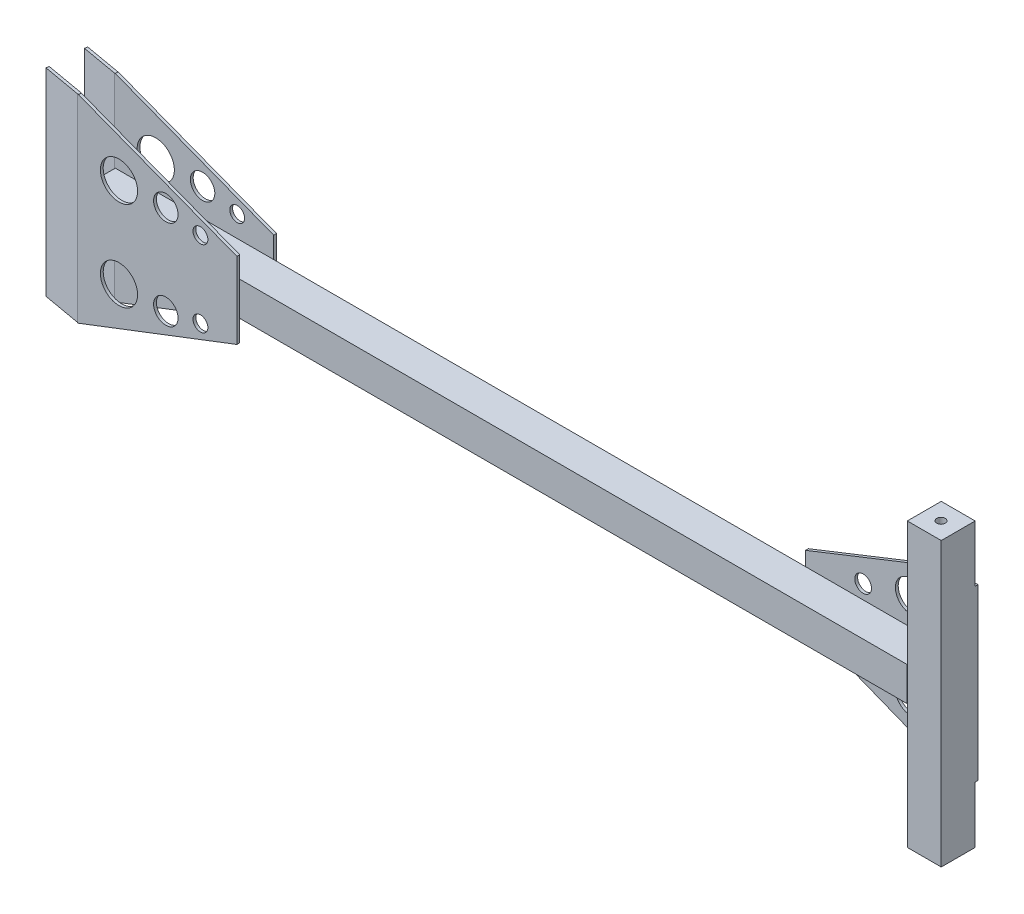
ISO-10303-21;
HEADER;
FILE_DESCRIPTION(('STEP AP214'),'2;1');
FILE_NAME('part.step','',(''),(''),'','','');
FILE_SCHEMA(('AUTOMOTIVE_DESIGN { 1 0 10303 214 1 1 1 1 }'));
ENDSEC;
DATA;
#1=APPLICATION_CONTEXT('core data for automotive mechanical design processes');
#2=APPLICATION_PROTOCOL_DEFINITION('international standard','automotive_design',2000,#1);
#3=PRODUCT_CONTEXT('',#1,'mechanical');
#4=PRODUCT('Part','Part','',(#3));
#5=PRODUCT_RELATED_PRODUCT_CATEGORY('part','',(#4));
#6=PRODUCT_DEFINITION_FORMATION('','',#4);
#7=PRODUCT_DEFINITION_CONTEXT('part definition',#1,'design');
#8=PRODUCT_DEFINITION('design','',#6,#7);
#9=PRODUCT_DEFINITION_SHAPE('','',#8);
#10=(LENGTH_UNIT() NAMED_UNIT(*) SI_UNIT(.MILLI.,.METRE.));
#11=(NAMED_UNIT(*) PLANE_ANGLE_UNIT() SI_UNIT($,.RADIAN.));
#12=(NAMED_UNIT(*) SI_UNIT($,.STERADIAN.) SOLID_ANGLE_UNIT());
#13=UNCERTAINTY_MEASURE_WITH_UNIT(LENGTH_MEASURE(1.E-05),#10,'distance_accuracy_value','');
#14=(GEOMETRIC_REPRESENTATION_CONTEXT(3) GLOBAL_UNCERTAINTY_ASSIGNED_CONTEXT((#13)) GLOBAL_UNIT_ASSIGNED_CONTEXT((#10,
#11,#12)) REPRESENTATION_CONTEXT('',''));
#15=CARTESIAN_POINT('',(0.,0.,0.));
#16=DIRECTION('',(0.,0.,1.));
#17=DIRECTION('',(1.,0.,0.));
#18=AXIS2_PLACEMENT_3D('',#15,#16,#17);
#19=CARTESIAN_POINT('',(112.,82.,-2.));
#20=DIRECTION('',(0.,0.,-1.));
#21=DIRECTION('',(1.,0.,0.));
#22=AXIS2_PLACEMENT_3D('',#19,#20,#21);
#23=PLANE('',#22);
#24=CARTESIAN_POINT('',(86.2027741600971,39.,-2.));
#25=DIRECTION('',(0.,0.,1.));
#26=DIRECTION('',(1.,0.,0.));
#27=AXIS2_PLACEMENT_3D('',#24,#25,#26);
#28=CIRCLE('',#27,5.25845282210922);
#29=CARTESIAN_POINT('',(91.4612269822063,39.,-2.));
#30=VERTEX_POINT('',#29);
#31=EDGE_CURVE('E482',#30,#30,#28,.T.);
#32=ORIENTED_EDGE('',*,*,#31,.T.);
#33=EDGE_LOOP('',(#32));
#34=FACE_BOUND('',#33,.T.);
#35=CARTESIAN_POINT('',(61.7210171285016,43.7209048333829,-2.));
#36=DIRECTION('',(0.,0.,1.));
#37=DIRECTION('',(1.,0.,0.));
#38=AXIS2_PLACEMENT_3D('',#35,#36,#37);
#39=CIRCLE('',#38,8.6558520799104);
#40=CARTESIAN_POINT('',(70.376869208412,43.7209048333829,-2.));
#41=VERTEX_POINT('',#40);
#42=EDGE_CURVE('E476',#41,#41,#39,.T.);
#43=ORIENTED_EDGE('',*,*,#42,.T.);
#44=EDGE_LOOP('',(#43));
#45=FACE_BOUND('',#44,.T.);
#46=CARTESIAN_POINT('',(28.5946941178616,43.7209048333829,-2.));
#47=DIRECTION('',(0.,0.,1.));
#48=DIRECTION('',(1.,0.,0.));
#49=AXIS2_PLACEMENT_3D('',#46,#47,#48);
#50=CIRCLE('',#49,13.1643638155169);
#51=CARTESIAN_POINT('',(41.7590579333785,43.7209048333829,-2.));
#52=VERTEX_POINT('',#51);
#53=EDGE_CURVE('E470',#52,#52,#50,.T.);
#54=ORIENTED_EDGE('',*,*,#53,.T.);
#55=EDGE_LOOP('',(#54));
#56=FACE_BOUND('',#55,.T.);
#57=CARTESIAN_POINT('',(86.2027741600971,-15.,-2.));
#58=DIRECTION('',(0.,0.,1.));
#59=DIRECTION('',(-1.,0.,0.));
#60=AXIS2_PLACEMENT_3D('',#57,#58,#59);
#61=CIRCLE('',#60,5.25845282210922);
#62=CARTESIAN_POINT('',(80.9443213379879,-15.,-2.));
#63=VERTEX_POINT('',#62);
#64=EDGE_CURVE('E464',#63,#63,#61,.T.);
#65=ORIENTED_EDGE('',*,*,#64,.T.);
#66=EDGE_LOOP('',(#65));
#67=FACE_BOUND('',#66,.T.);
#68=CARTESIAN_POINT('',(61.7210171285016,-19.7209048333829,-2.));
#69=DIRECTION('',(0.,0.,1.));
#70=DIRECTION('',(-1.,0.,0.));
#71=AXIS2_PLACEMENT_3D('',#68,#69,#70);
#72=CIRCLE('',#71,8.6558520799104);
#73=CARTESIAN_POINT('',(53.0651650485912,-19.7209048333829,-2.));
#74=VERTEX_POINT('',#73);
#75=EDGE_CURVE('E458',#74,#74,#72,.T.);
#76=ORIENTED_EDGE('',*,*,#75,.T.);
#77=EDGE_LOOP('',(#76));
#78=FACE_BOUND('',#77,.T.);
#79=CARTESIAN_POINT('',(28.5946941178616,-19.7209048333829,-2.));
#80=DIRECTION('',(0.,0.,1.));
#81=DIRECTION('',(-1.,0.,0.));
#82=AXIS2_PLACEMENT_3D('',#79,#80,#81);
#83=CIRCLE('',#82,13.1643638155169);
#84=CARTESIAN_POINT('',(15.4303303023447,-19.7209048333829,-2.));
#85=VERTEX_POINT('',#84);
#86=EDGE_CURVE('E452',#85,#85,#83,.T.);
#87=ORIENTED_EDGE('',*,*,#86,.T.);
#88=EDGE_LOOP('',(#87));
#89=FACE_BOUND('',#88,.T.);
#90=DIRECTION('',(1.,0.,0.));
#91=VECTOR('',#90,1.);
#92=CARTESIAN_POINT('',(0.,-58.,-2.));
#93=LINE('',#92,#91);
#94=CARTESIAN_POINT('',(-0.563432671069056,-58.,-2.));
#95=VERTEX_POINT('',#94);
#96=CARTESIAN_POINT('',(0.,-58.,-2.));
#97=VERTEX_POINT('',#96);
#98=EDGE_CURVE('E499',#95,#97,#93,.T.);
#99=ORIENTED_EDGE('',*,*,#98,.F.);
#100=DIRECTION('',(0.,1.,0.));
#101=VECTOR('',#100,1.);
#102=CARTESIAN_POINT('',(-0.563432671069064,82.,-2.));
#103=LINE('',#102,#101);
#104=CARTESIAN_POINT('',(-0.563432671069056,82.,-2.));
#105=VERTEX_POINT('',#104);
#106=EDGE_CURVE('E11',#95,#105,#103,.T.);
#107=ORIENTED_EDGE('',*,*,#106,.T.);
#108=DIRECTION('',(-1.,0.,0.));
#109=VECTOR('',#108,1.);
#110=CARTESIAN_POINT('',(-0.738409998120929,82.,-2.));
#111=LINE('',#110,#109);
#112=CARTESIAN_POINT('',(0.,82.,-2.));
#113=VERTEX_POINT('',#112);
#114=EDGE_CURVE('E278',#113,#105,#111,.T.);
#115=ORIENTED_EDGE('',*,*,#114,.F.);
#116=DIRECTION('',(-0.933560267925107,0.358420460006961,0.));
#117=VECTOR('',#116,1.);
#118=CARTESIAN_POINT('',(112.,39.,-2.));
#119=LINE('',#118,#117);
#120=CARTESIAN_POINT('',(112.,39.,-2.));
#121=VERTEX_POINT('',#120);
#122=EDGE_CURVE('E489',#121,#113,#119,.T.);
#123=ORIENTED_EDGE('',*,*,#122,.F.);
#124=DIRECTION('',(0.,1.,0.));
#125=VECTOR('',#124,1.);
#126=CARTESIAN_POINT('',(112.,-15.,-2.));
#127=LINE('',#126,#125);
#128=CARTESIAN_POINT('',(112.,-15.,-2.));
#129=VERTEX_POINT('',#128);
#130=EDGE_CURVE('E493',#129,#121,#127,.T.);
#131=ORIENTED_EDGE('',*,*,#130,.F.);
#132=DIRECTION('',(0.933560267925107,0.358420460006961,0.));
#133=VECTOR('',#132,1.);
#134=CARTESIAN_POINT('',(0.,-58.,-2.));
#135=LINE('',#134,#133);
#136=EDGE_CURVE('E496',#97,#129,#135,.T.);
#137=ORIENTED_EDGE('',*,*,#136,.F.);
#138=EDGE_LOOP('',(#99,#107,#115,#123,#131,#137));
#139=FACE_BOUND('',#138,.T.);
#140=ADVANCED_FACE('F32',(#34,#45,#56,#67,#78,#89,#139),#23,.T.);
#141=CARTESIAN_POINT('',(112.,82.,24.));
#142=DIRECTION('',(0.,0.,1.));
#143=DIRECTION('',(1.,0.,0.));
#144=AXIS2_PLACEMENT_3D('',#141,#142,#143);
#145=PLANE('',#144);
#146=CARTESIAN_POINT('',(61.7210171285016,43.7209048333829,24.));
#147=DIRECTION('',(0.,0.,1.));
#148=DIRECTION('',(1.,0.,0.));
#149=AXIS2_PLACEMENT_3D('',#146,#147,#148);
#150=CIRCLE('',#149,8.6558520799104);
#151=CARTESIAN_POINT('',(70.376869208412,43.7209048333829,24.));
#152=VERTEX_POINT('',#151);
#153=EDGE_CURVE('E550',#152,#152,#150,.T.);
#154=ORIENTED_EDGE('',*,*,#153,.T.);
#155=EDGE_LOOP('',(#154));
#156=FACE_BOUND('',#155,.T.);
#157=CARTESIAN_POINT('',(86.2027741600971,39.,24.));
#158=DIRECTION('',(0.,0.,1.));
#159=DIRECTION('',(1.,0.,0.));
#160=AXIS2_PLACEMENT_3D('',#157,#158,#159);
#161=CIRCLE('',#160,5.25845282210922);
#162=CARTESIAN_POINT('',(91.4612269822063,39.,24.));
#163=VERTEX_POINT('',#162);
#164=EDGE_CURVE('E556',#163,#163,#161,.T.);
#165=ORIENTED_EDGE('',*,*,#164,.T.);
#166=EDGE_LOOP('',(#165));
#167=FACE_BOUND('',#166,.T.);
#168=CARTESIAN_POINT('',(28.5946941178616,43.7209048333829,24.));
#169=DIRECTION('',(0.,0.,1.));
#170=DIRECTION('',(1.,0.,0.));
#171=AXIS2_PLACEMENT_3D('',#168,#169,#170);
#172=CIRCLE('',#171,13.1643638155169);
#173=CARTESIAN_POINT('',(41.7590579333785,43.7209048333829,24.));
#174=VERTEX_POINT('',#173);
#175=EDGE_CURVE('E544',#174,#174,#172,.T.);
#176=ORIENTED_EDGE('',*,*,#175,.T.);
#177=EDGE_LOOP('',(#176));
#178=FACE_BOUND('',#177,.T.);
#179=DIRECTION('',(0.,-1.,0.));
#180=VECTOR('',#179,1.);
#181=CARTESIAN_POINT('',(0.,82.,24.));
#182=LINE('',#181,#180);
#183=CARTESIAN_POINT('',(0.,82.,24.));
#184=VERTEX_POINT('',#183);
#185=CARTESIAN_POINT('',(0.,24.,24.));
#186=VERTEX_POINT('',#185);
#187=EDGE_CURVE('E332',#184,#186,#182,.T.);
#188=ORIENTED_EDGE('',*,*,#187,.F.);
#189=DIRECTION('',(-0.933560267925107,0.358420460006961,0.));
#190=VECTOR('',#189,1.);
#191=CARTESIAN_POINT('',(112.,39.,24.));
#192=LINE('',#191,#190);
#193=CARTESIAN_POINT('',(112.,39.,24.));
#194=VERTEX_POINT('',#193);
#195=EDGE_CURVE('E569',#194,#184,#192,.T.);
#196=ORIENTED_EDGE('',*,*,#195,.F.);
#197=DIRECTION('',(0.,1.,0.));
#198=VECTOR('',#197,1.);
#199=CARTESIAN_POINT('',(112.,-15.,24.));
#200=LINE('',#199,#198);
#201=CARTESIAN_POINT('',(112.,24.,24.));
#202=VERTEX_POINT('',#201);
#203=EDGE_CURVE('E585',#202,#194,#200,.T.);
#204=ORIENTED_EDGE('',*,*,#203,.F.);
#205=DIRECTION('',(-1.,0.,0.));
#206=VECTOR('',#205,1.);
#207=CARTESIAN_POINT('',(0.,24.,24.));
#208=LINE('',#207,#206);
#209=EDGE_CURVE('E618',#202,#186,#208,.T.);
#210=ORIENTED_EDGE('',*,*,#209,.T.);
#211=EDGE_LOOP('',(#188,#196,#204,#210));
#212=FACE_BOUND('',#211,.T.);
#213=ADVANCED_FACE('F709',(#156,#167,#178,#212),#145,.F.);
#214=CARTESIAN_POINT('',(0.,24.,0.));
#215=DIRECTION('',(0.,0.,-1.));
#216=DIRECTION('',(-1.,0.,0.));
#217=AXIS2_PLACEMENT_3D('',#214,#215,#216);
#218=PLANE('',#217);
#219=DIRECTION('',(-1.,0.,0.));
#220=VECTOR('',#219,1.);
#221=CARTESIAN_POINT('',(0.,24.,0.));
#222=LINE('',#221,#220);
#223=CARTESIAN_POINT('',(488.185893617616,24.,0.));
#224=VERTEX_POINT('',#223);
#225=CARTESIAN_POINT('',(112.,24.,0.));
#226=VERTEX_POINT('',#225);
#227=EDGE_CURVE('E634',#224,#226,#222,.T.);
#228=ORIENTED_EDGE('',*,*,#227,.F.);
#229=DIRECTION('',(0.,1.,0.));
#230=VECTOR('',#229,1.);
#231=CARTESIAN_POINT('',(488.185893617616,34.,0.));
#232=LINE('',#231,#230);
#233=CARTESIAN_POINT('',(488.185893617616,0.,0.));
#234=VERTEX_POINT('',#233);
#235=EDGE_CURVE('E427',#234,#224,#232,.T.);
#236=ORIENTED_EDGE('',*,*,#235,.F.);
#237=DIRECTION('',(1.,0.,0.));
#238=VECTOR('',#237,1.);
#239=CARTESIAN_POINT('',(0.,0.,0.));
#240=LINE('',#239,#238);
#241=CARTESIAN_POINT('',(112.,0.,0.));
#242=VERTEX_POINT('',#241);
#243=EDGE_CURVE('E624',#242,#234,#240,.T.);
#244=ORIENTED_EDGE('',*,*,#243,.F.);
#245=DIRECTION('',(0.,1.,0.));
#246=VECTOR('',#245,1.);
#247=CARTESIAN_POINT('',(112.,-15.,0.));
#248=LINE('',#247,#246);
#249=EDGE_CURVE('E512',#242,#226,#248,.T.);
#250=ORIENTED_EDGE('',*,*,#249,.T.);
#251=EDGE_LOOP('',(#228,#236,#244,#250));
#252=FACE_BOUND('',#251,.T.);
#253=ADVANCED_FACE('F739',(#252),#218,.T.);
#254=CARTESIAN_POINT('',(0.,24.,24.));
#255=DIRECTION('',(0.,0.,-1.));
#256=DIRECTION('',(-1.,0.,0.));
#257=AXIS2_PLACEMENT_3D('',#254,#255,#256);
#258=PLANE('',#257);
#259=CARTESIAN_POINT('',(112.,0.,24.));
#260=VERTEX_POINT('',#259);
#261=EDGE_CURVE('E589',#260,#202,#200,.T.);
#262=ORIENTED_EDGE('',*,*,#261,.F.);
#263=DIRECTION('',(1.,0.,0.));
#264=VECTOR('',#263,1.);
#265=CARTESIAN_POINT('',(0.,0.,24.));
#266=LINE('',#265,#264);
#267=CARTESIAN_POINT('',(584.,0.,24.));
#268=VERTEX_POINT('',#267);
#269=EDGE_CURVE('E611',#260,#268,#266,.T.);
#270=ORIENTED_EDGE('',*,*,#269,.T.);
#271=DIRECTION('',(0.,1.,0.));
#272=VECTOR('',#271,1.);
#273=CARTESIAN_POINT('',(584.,0.,24.));
#274=LINE('',#273,#272);
#275=CARTESIAN_POINT('',(584.,24.,24.));
#276=VERTEX_POINT('',#275);
#277=EDGE_CURVE('E616',#268,#276,#274,.T.);
#278=ORIENTED_EDGE('',*,*,#277,.T.);
#279=EDGE_CURVE('E619',#276,#202,#208,.T.);
#280=ORIENTED_EDGE('',*,*,#279,.T.);
#281=EDGE_LOOP('',(#262,#270,#278,#280));
#282=FACE_BOUND('',#281,.T.);
#283=ADVANCED_FACE('F812',(#282),#258,.F.);
#284=CARTESIAN_POINT('',(0.,0.,24.));
#285=DIRECTION('',(1.,0.,0.));
#286=DIRECTION('',(0.,0.,-1.));
#287=AXIS2_PLACEMENT_3D('',#284,#285,#286);
#288=PLANE('',#287);
#289=DIRECTION('',(0.,-1.,0.));
#290=VECTOR('',#289,1.);
#291=CARTESIAN_POINT('',(0.,0.,0.));
#292=LINE('',#291,#290);
#293=CARTESIAN_POINT('',(0.,24.,0.));
#294=VERTEX_POINT('',#293);
#295=CARTESIAN_POINT('',(0.,0.,0.));
#296=VERTEX_POINT('',#295);
#297=EDGE_CURVE('E607',#294,#296,#292,.T.);
#298=ORIENTED_EDGE('',*,*,#297,.T.);
#299=DIRECTION('',(0.,0.,-1.));
#300=VECTOR('',#299,1.);
#301=CARTESIAN_POINT('',(0.,0.,24.));
#302=LINE('',#301,#300);
#303=CARTESIAN_POINT('',(0.,0.,24.));
#304=VERTEX_POINT('',#303);
#305=EDGE_CURVE('E643',#304,#296,#302,.T.);
#306=ORIENTED_EDGE('',*,*,#305,.F.);
#307=DIRECTION('',(0.,-1.,0.));
#308=VECTOR('',#307,1.);
#309=CARTESIAN_POINT('',(0.,0.,24.));
#310=LINE('',#309,#308);
#311=EDGE_CURVE('E608',#186,#304,#310,.T.);
#312=ORIENTED_EDGE('',*,*,#311,.F.);
#313=DIRECTION('',(0.,0.,-1.));
#314=VECTOR('',#313,1.);
#315=CARTESIAN_POINT('',(0.,24.,24.));
#316=LINE('',#315,#314);
#317=EDGE_CURVE('E621',#186,#294,#316,.T.);
#318=ORIENTED_EDGE('',*,*,#317,.T.);
#319=EDGE_LOOP('',(#298,#306,#312,#318));
#320=FACE_BOUND('',#319,.T.);
#321=ADVANCED_FACE('F34',(#320),#288,.F.);
#322=CARTESIAN_POINT('',(0.,0.,24.));
#323=DIRECTION('',(0.,1.,0.));
#324=DIRECTION('',(0.,0.,1.));
#325=AXIS2_PLACEMENT_3D('',#322,#323,#324);
#326=PLANE('',#325);
#327=EDGE_CURVE('E625',#296,#242,#240,.T.);
#328=ORIENTED_EDGE('',*,*,#327,.T.);
#329=ORIENTED_EDGE('',*,*,#243,.T.);
#330=DIRECTION('',(-1.,0.,0.));
#331=VECTOR('',#330,1.);
#332=CARTESIAN_POINT('',(0.,0.,0.));
#333=LINE('',#332,#331);
#334=CARTESIAN_POINT('',(584.,0.,0.));
#335=VERTEX_POINT('',#334);
#336=EDGE_CURVE('E449',#335,#234,#333,.T.);
#337=ORIENTED_EDGE('',*,*,#336,.F.);
#338=DIRECTION('',(0.,0.,-1.));
#339=VECTOR('',#338,1.);
#340=CARTESIAN_POINT('',(584.,0.,24.));
#341=LINE('',#340,#339);
#342=EDGE_CURVE('E640',#268,#335,#341,.T.);
#343=ORIENTED_EDGE('',*,*,#342,.F.);
#344=ORIENTED_EDGE('',*,*,#269,.F.);
#345=EDGE_CURVE('E613',#304,#260,#266,.T.);
#346=ORIENTED_EDGE('',*,*,#345,.F.);
#347=ORIENTED_EDGE('',*,*,#305,.T.);
#348=EDGE_LOOP('',(#328,#329,#337,#343,#344,#346,#347));
#349=FACE_BOUND('',#348,.T.);
#350=ADVANCED_FACE('F674',(#349),#326,.F.);
#351=CARTESIAN_POINT('',(584.,0.,24.));
#352=DIRECTION('',(-1.,0.,0.));
#353=DIRECTION('',(0.,-1.,0.));
#354=AXIS2_PLACEMENT_3D('',#351,#352,#353);
#355=PLANE('',#354);
#356=DIRECTION('',(0.,1.,0.));
#357=VECTOR('',#356,1.);
#358=CARTESIAN_POINT('',(584.,0.,0.));
#359=LINE('',#358,#357);
#360=CARTESIAN_POINT('',(584.,24.,0.));
#361=VERTEX_POINT('',#360);
#362=EDGE_CURVE('E628',#335,#361,#359,.T.);
#363=ORIENTED_EDGE('',*,*,#362,.T.);
#364=DIRECTION('',(0.,0.,-1.));
#365=VECTOR('',#364,1.);
#366=CARTESIAN_POINT('',(584.,24.,24.));
#367=LINE('',#366,#365);
#368=EDGE_CURVE('E637',#276,#361,#367,.T.);
#369=ORIENTED_EDGE('',*,*,#368,.F.);
#370=ORIENTED_EDGE('',*,*,#277,.F.);
#371=ORIENTED_EDGE('',*,*,#342,.T.);
#372=EDGE_LOOP('',(#363,#369,#370,#371));
#373=FACE_BOUND('',#372,.T.);
#374=ADVANCED_FACE('F820',(#373),#355,.F.);
#375=CARTESIAN_POINT('',(0.,24.,24.));
#376=DIRECTION('',(0.,-1.,0.));
#377=DIRECTION('',(0.,0.,-1.));
#378=AXIS2_PLACEMENT_3D('',#375,#376,#377);
#379=PLANE('',#378);
#380=EDGE_CURVE('E612',#361,#224,#222,.T.);
#381=ORIENTED_EDGE('',*,*,#380,.T.);
#382=ORIENTED_EDGE('',*,*,#227,.T.);
#383=EDGE_CURVE('E631',#226,#294,#222,.T.);
#384=ORIENTED_EDGE('',*,*,#383,.T.);
#385=ORIENTED_EDGE('',*,*,#317,.F.);
#386=ORIENTED_EDGE('',*,*,#209,.F.);
#387=ORIENTED_EDGE('',*,*,#279,.F.);
#388=ORIENTED_EDGE('',*,*,#368,.T.);
#389=EDGE_LOOP('',(#381,#382,#384,#385,#386,#387,#388));
#390=FACE_BOUND('',#389,.T.);
#391=ADVANCED_FACE('F685',(#390),#379,.F.);
#392=CARTESIAN_POINT('',(28.5946941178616,-19.7209048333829,24.));
#393=DIRECTION('',(0.,0.,1.));
#394=DIRECTION('',(-1.,0.,0.));
#395=AXIS2_PLACEMENT_3D('',#392,#393,#394);
#396=CIRCLE('',#395,13.1643638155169);
#397=CARTESIAN_POINT('',(15.4303303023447,-19.7209048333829,24.));
#398=VERTEX_POINT('',#397);
#399=EDGE_CURVE('E528',#398,#398,#396,.T.);
#400=ORIENTED_EDGE('',*,*,#399,.T.);
#401=EDGE_LOOP('',(#400));
#402=FACE_BOUND('',#401,.T.);
#403=CARTESIAN_POINT('',(86.2027741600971,-15.,24.));
#404=DIRECTION('',(0.,0.,1.));
#405=DIRECTION('',(-1.,0.,0.));
#406=AXIS2_PLACEMENT_3D('',#403,#404,#405);
#407=CIRCLE('',#406,5.25845282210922);
#408=CARTESIAN_POINT('',(80.9443213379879,-15.,24.));
#409=VERTEX_POINT('',#408);
#410=EDGE_CURVE('E538',#409,#409,#407,.T.);
#411=ORIENTED_EDGE('',*,*,#410,.T.);
#412=EDGE_LOOP('',(#411));
#413=FACE_BOUND('',#412,.T.);
#414=CARTESIAN_POINT('',(61.7210171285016,-19.7209048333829,24.));
#415=DIRECTION('',(0.,0.,1.));
#416=DIRECTION('',(-1.,0.,0.));
#417=AXIS2_PLACEMENT_3D('',#414,#415,#416);
#418=CIRCLE('',#417,8.6558520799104);
#419=CARTESIAN_POINT('',(53.0651650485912,-19.7209048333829,24.));
#420=VERTEX_POINT('',#419);
#421=EDGE_CURVE('E532',#420,#420,#418,.T.);
#422=ORIENTED_EDGE('',*,*,#421,.T.);
#423=EDGE_LOOP('',(#422));
#424=FACE_BOUND('',#423,.T.);
#425=DIRECTION('',(0.,-1.,0.));
#426=VECTOR('',#425,1.);
#427=CARTESIAN_POINT('',(-0.738409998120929,82.,24.));
#428=LINE('',#427,#426);
#429=CARTESIAN_POINT('',(-0.738409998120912,-57.9445779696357,24.));
#430=VERTEX_POINT('',#429);
#431=CARTESIAN_POINT('',(-0.738409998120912,-58.,24.));
#432=VERTEX_POINT('',#431);
#433=EDGE_CURVE('E562',#430,#432,#428,.T.);
#434=ORIENTED_EDGE('',*,*,#433,.F.);
#435=DIRECTION('',(1.,0.,0.));
#436=VECTOR('',#435,1.);
#437=CARTESIAN_POINT('',(112.,-57.9445779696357,24.));
#438=LINE('',#437,#436);
#439=CARTESIAN_POINT('',(0.,-57.9445779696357,24.));
#440=VERTEX_POINT('',#439);
#441=EDGE_CURVE('E47',#430,#440,#438,.T.);
#442=ORIENTED_EDGE('',*,*,#441,.T.);
#443=EDGE_CURVE('E338',#304,#440,#182,.T.);
#444=ORIENTED_EDGE('',*,*,#443,.F.);
#445=ORIENTED_EDGE('',*,*,#345,.T.);
#446=CARTESIAN_POINT('',(112.,-15.,24.));
#447=VERTEX_POINT('',#446);
#448=EDGE_CURVE('E586',#447,#260,#200,.T.);
#449=ORIENTED_EDGE('',*,*,#448,.F.);
#450=DIRECTION('',(0.933560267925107,0.358420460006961,0.));
#451=VECTOR('',#450,1.);
#452=CARTESIAN_POINT('',(0.,-58.,24.));
#453=LINE('',#452,#451);
#454=CARTESIAN_POINT('',(0.,-58.,24.));
#455=VERTEX_POINT('',#454);
#456=EDGE_CURVE('E583',#455,#447,#453,.T.);
#457=ORIENTED_EDGE('',*,*,#456,.F.);
#458=DIRECTION('',(1.,0.,0.));
#459=VECTOR('',#458,1.);
#460=CARTESIAN_POINT('',(0.,-58.,24.));
#461=LINE('',#460,#459);
#462=EDGE_CURVE('E581',#432,#455,#461,.T.);
#463=ORIENTED_EDGE('',*,*,#462,.F.);
#464=EDGE_LOOP('',(#434,#442,#444,#445,#449,#457,#463));
#465=FACE_BOUND('',#464,.T.);
#466=ADVANCED_FACE('F660',(#402,#413,#424,#465),#145,.F.);
#467=CARTESIAN_POINT('',(112.,82.,26.));
#468=DIRECTION('',(0.,0.,1.));
#469=DIRECTION('',(1.,0.,0.));
#470=AXIS2_PLACEMENT_3D('',#467,#468,#469);
#471=PLANE('',#470);
#472=CARTESIAN_POINT('',(61.7210171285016,-19.7209048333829,26.));
#473=DIRECTION('',(0.,0.,1.));
#474=DIRECTION('',(-1.,0.,0.));
#475=AXIS2_PLACEMENT_3D('',#472,#473,#474);
#476=CIRCLE('',#475,8.6558520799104);
#477=CARTESIAN_POINT('',(53.0651650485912,-19.7209048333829,26.));
#478=VERTEX_POINT('',#477);
#479=EDGE_CURVE('E535',#478,#478,#476,.T.);
#480=ORIENTED_EDGE('',*,*,#479,.F.);
#481=EDGE_LOOP('',(#480));
#482=FACE_BOUND('',#481,.T.);
#483=CARTESIAN_POINT('',(28.5946941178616,43.7209048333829,26.));
#484=DIRECTION('',(0.,0.,1.));
#485=DIRECTION('',(1.,0.,0.));
#486=AXIS2_PLACEMENT_3D('',#483,#484,#485);
#487=CIRCLE('',#486,13.1643638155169);
#488=CARTESIAN_POINT('',(41.7590579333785,43.7209048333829,26.));
#489=VERTEX_POINT('',#488);
#490=EDGE_CURVE('E547',#489,#489,#487,.T.);
#491=ORIENTED_EDGE('',*,*,#490,.F.);
#492=EDGE_LOOP('',(#491));
#493=FACE_BOUND('',#492,.T.);
#494=CARTESIAN_POINT('',(86.2027741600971,39.,26.));
#495=DIRECTION('',(0.,0.,1.));
#496=DIRECTION('',(1.,0.,0.));
#497=AXIS2_PLACEMENT_3D('',#494,#495,#496);
#498=CIRCLE('',#497,5.25845282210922);
#499=CARTESIAN_POINT('',(91.4612269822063,39.,26.));
#500=VERTEX_POINT('',#499);
#501=EDGE_CURVE('E559',#500,#500,#498,.T.);
#502=ORIENTED_EDGE('',*,*,#501,.F.);
#503=EDGE_LOOP('',(#502));
#504=FACE_BOUND('',#503,.T.);
#505=DIRECTION('',(-1.,0.,0.));
#506=VECTOR('',#505,1.);
#507=CARTESIAN_POINT('',(-0.738409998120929,82.,26.));
#508=LINE('',#507,#506);
#509=CARTESIAN_POINT('',(0.,82.,26.));
#510=VERTEX_POINT('',#509);
#511=CARTESIAN_POINT('',(-0.738409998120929,82.,26.));
#512=VERTEX_POINT('',#511);
#513=EDGE_CURVE('E565',#510,#512,#508,.T.);
#514=ORIENTED_EDGE('',*,*,#513,.T.);
#515=DIRECTION('',(0.,-1.,0.));
#516=VECTOR('',#515,1.);
#517=CARTESIAN_POINT('',(-0.738409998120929,82.,26.));
#518=LINE('',#517,#516);
#519=CARTESIAN_POINT('',(-0.738409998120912,-58.,26.));
#520=VERTEX_POINT('',#519);
#521=EDGE_CURVE('E568',#512,#520,#518,.T.);
#522=ORIENTED_EDGE('',*,*,#521,.T.);
#523=DIRECTION('',(1.,0.,0.));
#524=VECTOR('',#523,1.);
#525=CARTESIAN_POINT('',(0.,-58.,26.));
#526=LINE('',#525,#524);
#527=CARTESIAN_POINT('',(0.,-58.,26.));
#528=VERTEX_POINT('',#527);
#529=EDGE_CURVE('E571',#520,#528,#526,.T.);
#530=ORIENTED_EDGE('',*,*,#529,.T.);
#531=DIRECTION('',(0.933560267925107,0.358420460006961,0.));
#532=VECTOR('',#531,1.);
#533=CARTESIAN_POINT('',(0.,-58.,26.));
#534=LINE('',#533,#532);
#535=CARTESIAN_POINT('',(112.,-15.,26.));
#536=VERTEX_POINT('',#535);
#537=EDGE_CURVE('E573',#528,#536,#534,.T.);
#538=ORIENTED_EDGE('',*,*,#537,.T.);
#539=DIRECTION('',(0.,1.,0.));
#540=VECTOR('',#539,1.);
#541=CARTESIAN_POINT('',(112.,-15.,26.));
#542=LINE('',#541,#540);
#543=CARTESIAN_POINT('',(112.,39.,26.));
#544=VERTEX_POINT('',#543);
#545=EDGE_CURVE('E575',#536,#544,#542,.T.);
#546=ORIENTED_EDGE('',*,*,#545,.T.);
#547=DIRECTION('',(-0.933560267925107,0.358420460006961,0.));
#548=VECTOR('',#547,1.);
#549=CARTESIAN_POINT('',(112.,39.,26.));
#550=LINE('',#549,#548);
#551=EDGE_CURVE('E577',#544,#510,#550,.T.);
#552=ORIENTED_EDGE('',*,*,#551,.T.);
#553=EDGE_LOOP('',(#514,#522,#530,#538,#546,#552));
#554=FACE_BOUND('',#553,.T.);
#555=CARTESIAN_POINT('',(61.7210171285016,43.7209048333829,26.));
#556=DIRECTION('',(0.,0.,1.));
#557=DIRECTION('',(1.,0.,0.));
#558=AXIS2_PLACEMENT_3D('',#555,#556,#557);
#559=CIRCLE('',#558,8.6558520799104);
#560=CARTESIAN_POINT('',(70.376869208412,43.7209048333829,26.));
#561=VERTEX_POINT('',#560);
#562=EDGE_CURVE('E553',#561,#561,#559,.T.);
#563=ORIENTED_EDGE('',*,*,#562,.F.);
#564=EDGE_LOOP('',(#563));
#565=FACE_BOUND('',#564,.T.);
#566=CARTESIAN_POINT('',(86.2027741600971,-15.,26.));
#567=DIRECTION('',(0.,0.,1.));
#568=DIRECTION('',(-1.,0.,0.));
#569=AXIS2_PLACEMENT_3D('',#566,#567,#568);
#570=CIRCLE('',#569,5.25845282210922);
#571=CARTESIAN_POINT('',(80.9443213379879,-15.,26.));
#572=VERTEX_POINT('',#571);
#573=EDGE_CURVE('E541',#572,#572,#570,.T.);
#574=ORIENTED_EDGE('',*,*,#573,.F.);
#575=EDGE_LOOP('',(#574));
#576=FACE_BOUND('',#575,.T.);
#577=CARTESIAN_POINT('',(28.5946941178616,-19.7209048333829,26.));
#578=DIRECTION('',(0.,0.,1.));
#579=DIRECTION('',(-1.,0.,0.));
#580=AXIS2_PLACEMENT_3D('',#577,#578,#579);
#581=CIRCLE('',#580,13.1643638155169);
#582=CARTESIAN_POINT('',(15.4303303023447,-19.7209048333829,26.));
#583=VERTEX_POINT('',#582);
#584=EDGE_CURVE('E529',#583,#583,#581,.T.);
#585=ORIENTED_EDGE('',*,*,#584,.F.);
#586=EDGE_LOOP('',(#585));
#587=FACE_BOUND('',#586,.T.);
#588=ADVANCED_FACE('F789',(#482,#493,#504,#554,#565,#576,#587),#471,.T.);
#589=CARTESIAN_POINT('',(-0.738409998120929,82.,26.));
#590=DIRECTION('',(0.,-1.,0.));
#591=DIRECTION('',(0.,0.,-1.));
#592=AXIS2_PLACEMENT_3D('',#589,#590,#591);
#593=PLANE('',#592);
#594=DIRECTION('',(0.,0.,-1.));
#595=VECTOR('',#594,1.);
#596=CARTESIAN_POINT('',(0.,82.,26.));
#597=LINE('',#596,#595);
#598=CARTESIAN_POINT('',(0.,82.,24.0223393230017));
#599=VERTEX_POINT('',#598);
#600=EDGE_CURVE('E579',#510,#599,#597,.T.);
#601=ORIENTED_EDGE('',*,*,#600,.T.);
#602=DIRECTION('',(-0.173648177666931,0.,0.984807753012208));
#603=VECTOR('',#602,1.);
#604=CARTESIAN_POINT('',(-0.360465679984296,82.,26.066641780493));
#605=LINE('',#604,#603);
#606=CARTESIAN_POINT('',(-0.343476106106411,82.,25.9702891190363));
#607=VERTEX_POINT('',#606);
#608=EDGE_CURVE('E55',#599,#607,#605,.T.);
#609=ORIENTED_EDGE('',*,*,#608,.T.);
#610=DIRECTION('',(-0.984807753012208,0.,-0.173648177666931));
#611=VECTOR('',#610,1.);
#612=CARTESIAN_POINT('',(-0.721420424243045,82.,25.9036473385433));
#613=LINE('',#612,#611);
#614=CARTESIAN_POINT('',(-0.738409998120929,82.,25.9006516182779));
#615=VERTEX_POINT('',#614);
#616=EDGE_CURVE('E340',#607,#615,#613,.T.);
#617=ORIENTED_EDGE('',*,*,#616,.T.);
#618=DIRECTION('',(0.,0.,-1.));
#619=VECTOR('',#618,1.);
#620=CARTESIAN_POINT('',(-0.738409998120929,82.,26.));
#621=LINE('',#620,#619);
#622=EDGE_CURVE('E604',#512,#615,#621,.T.);
#623=ORIENTED_EDGE('',*,*,#622,.F.);
#624=ORIENTED_EDGE('',*,*,#513,.F.);
#625=EDGE_LOOP('',(#601,#609,#617,#623,#624));
#626=FACE_BOUND('',#625,.T.);
#627=ADVANCED_FACE('F791',(#626),#593,.F.);
#628=CARTESIAN_POINT('',(-0.738409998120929,82.,26.));
#629=DIRECTION('',(1.,0.,0.));
#630=DIRECTION('',(0.,1.,0.));
#631=AXIS2_PLACEMENT_3D('',#628,#629,#630);
#632=PLANE('',#631);
#633=DIRECTION('',(0.,-1.,0.));
#634=VECTOR('',#633,1.);
#635=CARTESIAN_POINT('',(-0.738409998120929,82.,25.9006516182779));
#636=LINE('',#635,#634);
#637=CARTESIAN_POINT('',(-0.738409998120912,-57.9445779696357,25.9006516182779));
#638=VERTEX_POINT('',#637);
#639=EDGE_CURVE('E651',#615,#638,#636,.T.);
#640=ORIENTED_EDGE('',*,*,#639,.T.);
#641=DIRECTION('',(0.,0.,-1.));
#642=VECTOR('',#641,1.);
#643=CARTESIAN_POINT('',(-0.738409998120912,-57.9445779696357,26.));
#644=LINE('',#643,#642);
#645=EDGE_CURVE('E40',#638,#430,#644,.T.);
#646=ORIENTED_EDGE('',*,*,#645,.T.);
#647=ORIENTED_EDGE('',*,*,#433,.T.);
#648=DIRECTION('',(0.,0.,-1.));
#649=VECTOR('',#648,1.);
#650=CARTESIAN_POINT('',(-0.738409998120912,-58.,26.));
#651=LINE('',#650,#649);
#652=EDGE_CURVE('E601',#520,#432,#651,.T.);
#653=ORIENTED_EDGE('',*,*,#652,.F.);
#654=ORIENTED_EDGE('',*,*,#521,.F.);
#655=ORIENTED_EDGE('',*,*,#622,.T.);
#656=EDGE_LOOP('',(#640,#646,#647,#653,#654,#655));
#657=FACE_BOUND('',#656,.T.);
#658=ADVANCED_FACE('F654',(#657),#632,.F.);
#659=CARTESIAN_POINT('',(0.,-58.,26.));
#660=DIRECTION('',(0.,1.,0.));
#661=DIRECTION('',(-1.,0.,0.));
#662=AXIS2_PLACEMENT_3D('',#659,#660,#661);
#663=PLANE('',#662);
#664=ORIENTED_EDGE('',*,*,#462,.T.);
#665=DIRECTION('',(0.,0.,-1.));
#666=VECTOR('',#665,1.);
#667=CARTESIAN_POINT('',(0.,-58.,26.));
#668=LINE('',#667,#666);
#669=EDGE_CURVE('E598',#528,#455,#668,.T.);
#670=ORIENTED_EDGE('',*,*,#669,.F.);
#671=ORIENTED_EDGE('',*,*,#529,.F.);
#672=ORIENTED_EDGE('',*,*,#652,.T.);
#673=EDGE_LOOP('',(#664,#670,#671,#672));
#674=FACE_BOUND('',#673,.T.);
#675=ADVANCED_FACE('F803',(#674),#663,.F.);
#676=CARTESIAN_POINT('',(0.,-58.,26.));
#677=DIRECTION('',(-0.358420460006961,0.933560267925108,0.));
#678=DIRECTION('',(-0.933560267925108,-0.358420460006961,0.));
#679=AXIS2_PLACEMENT_3D('',#676,#677,#678);
#680=PLANE('',#679);
#681=ORIENTED_EDGE('',*,*,#456,.T.);
#682=DIRECTION('',(0.,0.,-1.));
#683=VECTOR('',#682,1.);
#684=CARTESIAN_POINT('',(112.,-15.,26.));
#685=LINE('',#684,#683);
#686=EDGE_CURVE('E595',#536,#447,#685,.T.);
#687=ORIENTED_EDGE('',*,*,#686,.F.);
#688=ORIENTED_EDGE('',*,*,#537,.F.);
#689=ORIENTED_EDGE('',*,*,#669,.T.);
#690=EDGE_LOOP('',(#681,#687,#688,#689));
#691=FACE_BOUND('',#690,.T.);
#692=ADVANCED_FACE('F800',(#691),#680,.F.);
#693=CARTESIAN_POINT('',(112.,-15.,26.));
#694=DIRECTION('',(-1.,0.,0.));
#695=DIRECTION('',(0.,-1.,0.));
#696=AXIS2_PLACEMENT_3D('',#693,#694,#695);
#697=PLANE('',#696);
#698=ORIENTED_EDGE('',*,*,#448,.T.);
#699=ORIENTED_EDGE('',*,*,#261,.T.);
#700=ORIENTED_EDGE('',*,*,#203,.T.);
#701=DIRECTION('',(0.,0.,-1.));
#702=VECTOR('',#701,1.);
#703=CARTESIAN_POINT('',(112.,39.,26.));
#704=LINE('',#703,#702);
#705=EDGE_CURVE('E592',#544,#194,#704,.T.);
#706=ORIENTED_EDGE('',*,*,#705,.F.);
#707=ORIENTED_EDGE('',*,*,#545,.F.);
#708=ORIENTED_EDGE('',*,*,#686,.T.);
#709=EDGE_LOOP('',(#698,#699,#700,#706,#707,#708));
#710=FACE_BOUND('',#709,.T.);
#711=ADVANCED_FACE('F700',(#710),#697,.F.);
#712=CARTESIAN_POINT('',(112.,39.,26.));
#713=DIRECTION('',(-0.358420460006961,-0.933560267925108,0.));
#714=DIRECTION('',(0.933560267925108,-0.358420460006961,0.));
#715=AXIS2_PLACEMENT_3D('',#712,#713,#714);
#716=PLANE('',#715);
#717=DIRECTION('',(-0.921163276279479,0.353660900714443,-0.162425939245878));
#718=VECTOR('',#717,1.);
#719=CARTESIAN_POINT('',(109.344436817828,40.0195465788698,43.2803744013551));
#720=LINE('',#719,#718);
#721=CARTESIAN_POINT('',(0.00382024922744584,81.9985332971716,24.0006736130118));
#722=VERTEX_POINT('',#721);
#723=EDGE_CURVE('E646',#722,#184,#720,.T.);
#724=ORIENTED_EDGE('',*,*,#723,.F.);
#725=DIRECTION('',(-0.173263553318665,0.0665208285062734,0.982626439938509));
#726=VECTOR('',#725,1.);
#727=CARTESIAN_POINT('',(3.52116795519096,80.6481230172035,4.05280351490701));
#728=LINE('',#727,#726);
#729=EDGE_CURVE('E649',#722,#599,#728,.T.);
#730=ORIENTED_EDGE('',*,*,#729,.T.);
#731=ORIENTED_EDGE('',*,*,#600,.F.);
#732=ORIENTED_EDGE('',*,*,#551,.F.);
#733=ORIENTED_EDGE('',*,*,#705,.T.);
#734=ORIENTED_EDGE('',*,*,#195,.T.);
#735=EDGE_LOOP('',(#724,#730,#731,#732,#733,#734));
#736=FACE_BOUND('',#735,.T.);
#737=ADVANCED_FACE('F706',(#736),#716,.F.);
#738=CARTESIAN_POINT('',(86.2027741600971,39.,26.));
#739=DIRECTION('',(0.,0.,-1.));
#740=DIRECTION('',(-1.,0.,0.));
#741=AXIS2_PLACEMENT_3D('',#738,#739,#740);
#742=CYLINDRICAL_SURFACE('',#741,5.25845282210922);
#743=ORIENTED_EDGE('',*,*,#501,.T.);
#744=EDGE_LOOP('',(#743));
#745=FACE_BOUND('',#744,.T.);
#746=ORIENTED_EDGE('',*,*,#164,.F.);
#747=EDGE_LOOP('',(#746));
#748=FACE_BOUND('',#747,.T.);
#749=ADVANCED_FACE('F784',(#745,#748),#742,.F.);
#750=CARTESIAN_POINT('',(61.7210171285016,43.7209048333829,26.));
#751=DIRECTION('',(0.,0.,-1.));
#752=DIRECTION('',(-1.,0.,0.));
#753=AXIS2_PLACEMENT_3D('',#750,#751,#752);
#754=CYLINDRICAL_SURFACE('',#753,8.6558520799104);
#755=ORIENTED_EDGE('',*,*,#562,.T.);
#756=EDGE_LOOP('',(#755));
#757=FACE_BOUND('',#756,.T.);
#758=ORIENTED_EDGE('',*,*,#153,.F.);
#759=EDGE_LOOP('',(#758));
#760=FACE_BOUND('',#759,.T.);
#761=ADVANCED_FACE('F780',(#757,#760),#754,.F.);
#762=CARTESIAN_POINT('',(28.5946941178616,43.7209048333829,26.));
#763=DIRECTION('',(0.,0.,-1.));
#764=DIRECTION('',(-1.,0.,0.));
#765=AXIS2_PLACEMENT_3D('',#762,#763,#764);
#766=CYLINDRICAL_SURFACE('',#765,13.1643638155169);
#767=ORIENTED_EDGE('',*,*,#490,.T.);
#768=EDGE_LOOP('',(#767));
#769=FACE_BOUND('',#768,.T.);
#770=ORIENTED_EDGE('',*,*,#175,.F.);
#771=EDGE_LOOP('',(#770));
#772=FACE_BOUND('',#771,.T.);
#773=ADVANCED_FACE('F776',(#769,#772),#766,.F.);
#774=CARTESIAN_POINT('',(86.2027741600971,-15.,26.));
#775=DIRECTION('',(0.,0.,-1.));
#776=DIRECTION('',(-1.,0.,0.));
#777=AXIS2_PLACEMENT_3D('',#774,#775,#776);
#778=CYLINDRICAL_SURFACE('',#777,5.25845282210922);
#779=ORIENTED_EDGE('',*,*,#573,.T.);
#780=EDGE_LOOP('',(#779));
#781=FACE_BOUND('',#780,.T.);
#782=ORIENTED_EDGE('',*,*,#410,.F.);
#783=EDGE_LOOP('',(#782));
#784=FACE_BOUND('',#783,.T.);
#785=ADVANCED_FACE('F772',(#781,#784),#778,.F.);
#786=CARTESIAN_POINT('',(61.7210171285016,-19.7209048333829,26.));
#787=DIRECTION('',(0.,0.,-1.));
#788=DIRECTION('',(-1.,0.,0.));
#789=AXIS2_PLACEMENT_3D('',#786,#787,#788);
#790=CYLINDRICAL_SURFACE('',#789,8.6558520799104);
#791=ORIENTED_EDGE('',*,*,#479,.T.);
#792=EDGE_LOOP('',(#791));
#793=FACE_BOUND('',#792,.T.);
#794=ORIENTED_EDGE('',*,*,#421,.F.);
#795=EDGE_LOOP('',(#794));
#796=FACE_BOUND('',#795,.T.);
#797=ADVANCED_FACE('F768',(#793,#796),#790,.F.);
#798=CARTESIAN_POINT('',(28.5946941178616,-19.7209048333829,26.));
#799=DIRECTION('',(0.,0.,-1.));
#800=DIRECTION('',(-1.,0.,0.));
#801=AXIS2_PLACEMENT_3D('',#798,#799,#800);
#802=CYLINDRICAL_SURFACE('',#801,13.1643638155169);
#803=ORIENTED_EDGE('',*,*,#584,.T.);
#804=EDGE_LOOP('',(#803));
#805=FACE_BOUND('',#804,.T.);
#806=ORIENTED_EDGE('',*,*,#399,.F.);
#807=EDGE_LOOP('',(#806));
#808=FACE_BOUND('',#807,.T.);
#809=ADVANCED_FACE('F765',(#805,#808),#802,.F.);
#810=CARTESIAN_POINT('',(-0.738409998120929,82.,-2.));
#811=DIRECTION('',(0.,1.,0.));
#812=DIRECTION('',(0.,0.,1.));
#813=AXIS2_PLACEMENT_3D('',#810,#811,#812);
#814=PLANE('',#813);
#815=DIRECTION('',(-0.984807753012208,0.,-0.173648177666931));
#816=VECTOR('',#815,1.);
#817=CARTESIAN_POINT('',(-0.738409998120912,82.,0.));
#818=LINE('',#817,#816);
#819=CARTESIAN_POINT('',(-0.738409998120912,82.,0.));
#820=VERTEX_POINT('',#819);
#821=CARTESIAN_POINT('',(-26.3434115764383,82.,-4.5148526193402));
#822=VERTEX_POINT('',#821);
#823=EDGE_CURVE('E300',#820,#822,#818,.T.);
#824=ORIENTED_EDGE('',*,*,#823,.F.);
#825=DIRECTION('',(-1.,0.,0.));
#826=VECTOR('',#825,1.);
#827=CARTESIAN_POINT('',(-0.738409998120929,82.,0.));
#828=LINE('',#827,#826);
#829=CARTESIAN_POINT('',(0.,82.,0.));
#830=VERTEX_POINT('',#829);
#831=EDGE_CURVE('E485',#830,#820,#828,.T.);
#832=ORIENTED_EDGE('',*,*,#831,.F.);
#833=DIRECTION('',(0.,0.,1.));
#834=VECTOR('',#833,1.);
#835=CARTESIAN_POINT('',(0.,82.,-2.));
#836=LINE('',#835,#834);
#837=EDGE_CURVE('E526',#113,#830,#836,.T.);
#838=ORIENTED_EDGE('',*,*,#837,.F.);
#839=ORIENTED_EDGE('',*,*,#114,.T.);
#840=DIRECTION('',(-0.984807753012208,0.,-0.173648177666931));
#841=VECTOR('',#840,1.);
#842=CARTESIAN_POINT('',(-0.39111364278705,82.,-1.96961550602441));
#843=LINE('',#842,#841);
#844=CARTESIAN_POINT('',(-25.9961152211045,82.,-6.48446812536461));
#845=VERTEX_POINT('',#844);
#846=EDGE_CURVE('E272',#105,#845,#843,.T.);
#847=ORIENTED_EDGE('',*,*,#846,.T.);
#848=DIRECTION('',(-0.173648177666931,0.,0.984807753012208));
#849=VECTOR('',#848,1.);
#850=CARTESIAN_POINT('',(-25.9961152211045,82.,-6.48446812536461));
#851=LINE('',#850,#849);
#852=EDGE_CURVE('E275',#845,#822,#851,.T.);
#853=ORIENTED_EDGE('',*,*,#852,.T.);
#854=EDGE_LOOP('',(#824,#832,#838,#839,#847,#853));
#855=FACE_BOUND('',#854,.T.);
#856=ADVANCED_FACE('F274',(#855),#814,.T.);
#857=CARTESIAN_POINT('',(112.,39.,-2.));
#858=DIRECTION('',(0.358420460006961,0.933560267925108,0.));
#859=DIRECTION('',(-0.933560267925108,0.358420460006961,0.));
#860=AXIS2_PLACEMENT_3D('',#857,#858,#859);
#861=PLANE('',#860);
#862=DIRECTION('',(-0.933560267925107,0.358420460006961,0.));
#863=VECTOR('',#862,1.);
#864=CARTESIAN_POINT('',(112.,39.,0.));
#865=LINE('',#864,#863);
#866=CARTESIAN_POINT('',(112.,39.,0.));
#867=VERTEX_POINT('',#866);
#868=EDGE_CURVE('E504',#867,#830,#865,.T.);
#869=ORIENTED_EDGE('',*,*,#868,.F.);
#870=DIRECTION('',(0.,0.,1.));
#871=VECTOR('',#870,1.);
#872=CARTESIAN_POINT('',(112.,39.,-2.));
#873=LINE('',#872,#871);
#874=EDGE_CURVE('E523',#121,#867,#873,.T.);
#875=ORIENTED_EDGE('',*,*,#874,.F.);
#876=ORIENTED_EDGE('',*,*,#122,.T.);
#877=ORIENTED_EDGE('',*,*,#837,.T.);
#878=EDGE_LOOP('',(#869,#875,#876,#877));
#879=FACE_BOUND('',#878,.T.);
#880=ADVANCED_FACE('F759',(#879),#861,.T.);
#881=CARTESIAN_POINT('',(112.,-15.,-2.));
#882=DIRECTION('',(1.,0.,0.));
#883=DIRECTION('',(0.,1.,0.));
#884=AXIS2_PLACEMENT_3D('',#881,#882,#883);
#885=PLANE('',#884);
#886=CARTESIAN_POINT('',(112.,-15.,0.));
#887=VERTEX_POINT('',#886);
#888=EDGE_CURVE('E508',#887,#242,#248,.T.);
#889=ORIENTED_EDGE('',*,*,#888,.F.);
#890=DIRECTION('',(0.,0.,1.));
#891=VECTOR('',#890,1.);
#892=CARTESIAN_POINT('',(112.,-15.,-2.));
#893=LINE('',#892,#891);
#894=EDGE_CURVE('E521',#129,#887,#893,.T.);
#895=ORIENTED_EDGE('',*,*,#894,.F.);
#896=ORIENTED_EDGE('',*,*,#130,.T.);
#897=ORIENTED_EDGE('',*,*,#874,.T.);
#898=EDGE_CURVE('E507',#226,#867,#248,.T.);
#899=ORIENTED_EDGE('',*,*,#898,.F.);
#900=ORIENTED_EDGE('',*,*,#249,.F.);
#901=EDGE_LOOP('',(#889,#895,#896,#897,#899,#900));
#902=FACE_BOUND('',#901,.T.);
#903=ADVANCED_FACE('F693',(#902),#885,.T.);
#904=CARTESIAN_POINT('',(0.,-58.,-2.));
#905=DIRECTION('',(0.358420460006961,-0.933560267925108,0.));
#906=DIRECTION('',(0.933560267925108,0.358420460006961,0.));
#907=AXIS2_PLACEMENT_3D('',#904,#905,#906);
#908=PLANE('',#907);
#909=DIRECTION('',(0.933560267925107,0.358420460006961,0.));
#910=VECTOR('',#909,1.);
#911=CARTESIAN_POINT('',(0.,-58.,0.));
#912=LINE('',#911,#910);
#913=CARTESIAN_POINT('',(0.,-58.,0.));
#914=VERTEX_POINT('',#913);
#915=EDGE_CURVE('E511',#914,#887,#912,.T.);
#916=ORIENTED_EDGE('',*,*,#915,.F.);
#917=DIRECTION('',(0.,0.,1.));
#918=VECTOR('',#917,1.);
#919=CARTESIAN_POINT('',(0.,-58.,-2.));
#920=LINE('',#919,#918);
#921=EDGE_CURVE('E501',#97,#914,#920,.T.);
#922=ORIENTED_EDGE('',*,*,#921,.F.);
#923=ORIENTED_EDGE('',*,*,#136,.T.);
#924=ORIENTED_EDGE('',*,*,#894,.T.);
#925=EDGE_LOOP('',(#916,#922,#923,#924));
#926=FACE_BOUND('',#925,.T.);
#927=ADVANCED_FACE('F752',(#926),#908,.T.);
#928=CARTESIAN_POINT('',(0.,-58.,-2.));
#929=DIRECTION('',(0.,-1.,0.));
#930=DIRECTION('',(1.,0.,0.));
#931=AXIS2_PLACEMENT_3D('',#928,#929,#930);
#932=PLANE('',#931);
#933=DIRECTION('',(1.,0.,0.));
#934=VECTOR('',#933,1.);
#935=CARTESIAN_POINT('',(0.,-58.,0.));
#936=LINE('',#935,#934);
#937=CARTESIAN_POINT('',(-0.738409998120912,-58.,0.));
#938=VERTEX_POINT('',#937);
#939=EDGE_CURVE('E515',#938,#914,#936,.T.);
#940=ORIENTED_EDGE('',*,*,#939,.F.);
#941=DIRECTION('',(0.984807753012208,0.,0.173648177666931));
#942=VECTOR('',#941,1.);
#943=CARTESIAN_POINT('',(-0.738409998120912,-58.,0.));
#944=LINE('',#943,#942);
#945=CARTESIAN_POINT('',(-26.3434115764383,-58.,-4.5148526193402));
#946=VERTEX_POINT('',#945);
#947=EDGE_CURVE('E282',#946,#938,#944,.T.);
#948=ORIENTED_EDGE('',*,*,#947,.F.);
#949=DIRECTION('',(-0.173648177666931,0.,0.984807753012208));
#950=VECTOR('',#949,1.);
#951=CARTESIAN_POINT('',(-25.9961152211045,-58.,-6.48446812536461));
#952=LINE('',#951,#950);
#953=CARTESIAN_POINT('',(-25.9961152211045,-58.,-6.48446812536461));
#954=VERTEX_POINT('',#953);
#955=EDGE_CURVE('E291',#954,#946,#952,.T.);
#956=ORIENTED_EDGE('',*,*,#955,.F.);
#957=DIRECTION('',(0.984807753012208,0.,0.173648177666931));
#958=VECTOR('',#957,1.);
#959=CARTESIAN_POINT('',(-0.39111364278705,-58.,-1.96961550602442));
#960=LINE('',#959,#958);
#961=EDGE_CURVE('E292',#954,#95,#960,.T.);
#962=ORIENTED_EDGE('',*,*,#961,.T.);
#963=ORIENTED_EDGE('',*,*,#98,.T.);
#964=ORIENTED_EDGE('',*,*,#921,.T.);
#965=EDGE_LOOP('',(#940,#948,#956,#962,#963,#964));
#966=FACE_BOUND('',#965,.T.);
#967=ADVANCED_FACE('F749',(#966),#932,.T.);
#968=CARTESIAN_POINT('',(112.,82.,0.));
#969=DIRECTION('',(0.,0.,-1.));
#970=DIRECTION('',(1.,0.,0.));
#971=AXIS2_PLACEMENT_3D('',#968,#969,#970);
#972=PLANE('',#971);
#973=ORIENTED_EDGE('',*,*,#383,.F.);
#974=ORIENTED_EDGE('',*,*,#898,.T.);
#975=ORIENTED_EDGE('',*,*,#868,.T.);
#976=ORIENTED_EDGE('',*,*,#831,.T.);
#977=DIRECTION('',(0.,-1.,0.));
#978=VECTOR('',#977,1.);
#979=CARTESIAN_POINT('',(-0.738409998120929,82.,0.));
#980=LINE('',#979,#978);
#981=EDGE_CURVE('E490',#820,#938,#980,.T.);
#982=ORIENTED_EDGE('',*,*,#981,.T.);
#983=ORIENTED_EDGE('',*,*,#939,.T.);
#984=ORIENTED_EDGE('',*,*,#915,.T.);
#985=ORIENTED_EDGE('',*,*,#888,.T.);
#986=ORIENTED_EDGE('',*,*,#327,.F.);
#987=ORIENTED_EDGE('',*,*,#297,.F.);
#988=EDGE_LOOP('',(#973,#974,#975,#976,#982,#983,#984,#985,#986,#987));
#989=FACE_BOUND('',#988,.T.);
#990=CARTESIAN_POINT('',(28.5946941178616,-19.7209048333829,0.));
#991=DIRECTION('',(0.,0.,1.));
#992=DIRECTION('',(-1.,0.,0.));
#993=AXIS2_PLACEMENT_3D('',#990,#991,#992);
#994=CIRCLE('',#993,13.1643638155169);
#995=CARTESIAN_POINT('',(15.4303303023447,-19.7209048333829,0.));
#996=VERTEX_POINT('',#995);
#997=EDGE_CURVE('E451',#996,#996,#994,.T.);
#998=ORIENTED_EDGE('',*,*,#997,.F.);
#999=EDGE_LOOP('',(#998));
#1000=FACE_BOUND('',#999,.T.);
#1001=CARTESIAN_POINT('',(61.7210171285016,-19.7209048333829,0.));
#1002=DIRECTION('',(0.,0.,1.));
#1003=DIRECTION('',(-1.,0.,0.));
#1004=AXIS2_PLACEMENT_3D('',#1001,#1002,#1003);
#1005=CIRCLE('',#1004,8.6558520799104);
#1006=CARTESIAN_POINT('',(53.0651650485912,-19.7209048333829,0.));
#1007=VERTEX_POINT('',#1006);
#1008=EDGE_CURVE('E455',#1007,#1007,#1005,.T.);
#1009=ORIENTED_EDGE('',*,*,#1008,.F.);
#1010=EDGE_LOOP('',(#1009));
#1011=FACE_BOUND('',#1010,.T.);
#1012=CARTESIAN_POINT('',(86.2027741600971,-15.,0.));
#1013=DIRECTION('',(0.,0.,1.));
#1014=DIRECTION('',(-1.,0.,0.));
#1015=AXIS2_PLACEMENT_3D('',#1012,#1013,#1014);
#1016=CIRCLE('',#1015,5.25845282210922);
#1017=CARTESIAN_POINT('',(80.9443213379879,-15.,0.));
#1018=VERTEX_POINT('',#1017);
#1019=EDGE_CURVE('E461',#1018,#1018,#1016,.T.);
#1020=ORIENTED_EDGE('',*,*,#1019,.F.);
#1021=EDGE_LOOP('',(#1020));
#1022=FACE_BOUND('',#1021,.T.);
#1023=CARTESIAN_POINT('',(28.5946941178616,43.7209048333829,0.));
#1024=DIRECTION('',(0.,0.,1.));
#1025=DIRECTION('',(1.,0.,0.));
#1026=AXIS2_PLACEMENT_3D('',#1023,#1024,#1025);
#1027=CIRCLE('',#1026,13.1643638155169);
#1028=CARTESIAN_POINT('',(41.7590579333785,43.7209048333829,0.));
#1029=VERTEX_POINT('',#1028);
#1030=EDGE_CURVE('E467',#1029,#1029,#1027,.T.);
#1031=ORIENTED_EDGE('',*,*,#1030,.F.);
#1032=EDGE_LOOP('',(#1031));
#1033=FACE_BOUND('',#1032,.T.);
#1034=CARTESIAN_POINT('',(61.7210171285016,43.7209048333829,0.));
#1035=DIRECTION('',(0.,0.,1.));
#1036=DIRECTION('',(1.,0.,0.));
#1037=AXIS2_PLACEMENT_3D('',#1034,#1035,#1036);
#1038=CIRCLE('',#1037,8.6558520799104);
#1039=CARTESIAN_POINT('',(70.376869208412,43.7209048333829,0.));
#1040=VERTEX_POINT('',#1039);
#1041=EDGE_CURVE('E473',#1040,#1040,#1038,.T.);
#1042=ORIENTED_EDGE('',*,*,#1041,.F.);
#1043=EDGE_LOOP('',(#1042));
#1044=FACE_BOUND('',#1043,.T.);
#1045=CARTESIAN_POINT('',(86.2027741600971,39.,0.));
#1046=DIRECTION('',(0.,0.,1.));
#1047=DIRECTION('',(1.,0.,0.));
#1048=AXIS2_PLACEMENT_3D('',#1045,#1046,#1047);
#1049=CIRCLE('',#1048,5.25845282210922);
#1050=CARTESIAN_POINT('',(91.4612269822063,39.,0.));
#1051=VERTEX_POINT('',#1050);
#1052=EDGE_CURVE('E479',#1051,#1051,#1049,.T.);
#1053=ORIENTED_EDGE('',*,*,#1052,.F.);
#1054=EDGE_LOOP('',(#1053));
#1055=FACE_BOUND('',#1054,.T.);
#1056=ADVANCED_FACE('F681',(#989,#1000,#1011,#1022,#1033,#1044,#1055),#972,.F.);
#1057=CARTESIAN_POINT('',(86.2027741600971,39.,-2.));
#1058=DIRECTION('',(0.,0.,1.));
#1059=DIRECTION('',(1.,0.,0.));
#1060=AXIS2_PLACEMENT_3D('',#1057,#1058,#1059);
#1061=CYLINDRICAL_SURFACE('',#1060,5.25845282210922);
#1062=ORIENTED_EDGE('',*,*,#31,.F.);
#1063=EDGE_LOOP('',(#1062));
#1064=FACE_BOUND('',#1063,.T.);
#1065=ORIENTED_EDGE('',*,*,#1052,.T.);
#1066=EDGE_LOOP('',(#1065));
#1067=FACE_BOUND('',#1066,.T.);
#1068=ADVANCED_FACE('F745',(#1064,#1067),#1061,.F.);
#1069=CARTESIAN_POINT('',(61.7210171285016,43.7209048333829,-2.));
#1070=DIRECTION('',(0.,0.,1.));
#1071=DIRECTION('',(1.,0.,0.));
#1072=AXIS2_PLACEMENT_3D('',#1069,#1070,#1071);
#1073=CYLINDRICAL_SURFACE('',#1072,8.6558520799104);
#1074=ORIENTED_EDGE('',*,*,#42,.F.);
#1075=EDGE_LOOP('',(#1074));
#1076=FACE_BOUND('',#1075,.T.);
#1077=ORIENTED_EDGE('',*,*,#1041,.T.);
#1078=EDGE_LOOP('',(#1077));
#1079=FACE_BOUND('',#1078,.T.);
#1080=ADVANCED_FACE('F1112',(#1076,#1079),#1073,.F.);
#1081=CARTESIAN_POINT('',(28.5946941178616,43.7209048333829,-2.));
#1082=DIRECTION('',(0.,0.,1.));
#1083=DIRECTION('',(1.,0.,0.));
#1084=AXIS2_PLACEMENT_3D('',#1081,#1082,#1083);
#1085=CYLINDRICAL_SURFACE('',#1084,13.1643638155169);
#1086=ORIENTED_EDGE('',*,*,#53,.F.);
#1087=EDGE_LOOP('',(#1086));
#1088=FACE_BOUND('',#1087,.T.);
#1089=ORIENTED_EDGE('',*,*,#1030,.T.);
#1090=EDGE_LOOP('',(#1089));
#1091=FACE_BOUND('',#1090,.T.);
#1092=ADVANCED_FACE('F1119',(#1088,#1091),#1085,.F.);
#1093=CARTESIAN_POINT('',(86.2027741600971,-15.,-2.));
#1094=DIRECTION('',(0.,0.,1.));
#1095=DIRECTION('',(1.,0.,0.));
#1096=AXIS2_PLACEMENT_3D('',#1093,#1094,#1095);
#1097=CYLINDRICAL_SURFACE('',#1096,5.25845282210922);
#1098=ORIENTED_EDGE('',*,*,#64,.F.);
#1099=EDGE_LOOP('',(#1098));
#1100=FACE_BOUND('',#1099,.T.);
#1101=ORIENTED_EDGE('',*,*,#1019,.T.);
#1102=EDGE_LOOP('',(#1101));
#1103=FACE_BOUND('',#1102,.T.);
#1104=ADVANCED_FACE('F1126',(#1100,#1103),#1097,.F.);
#1105=CARTESIAN_POINT('',(61.7210171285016,-19.7209048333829,-2.));
#1106=DIRECTION('',(0.,0.,1.));
#1107=DIRECTION('',(1.,0.,0.));
#1108=AXIS2_PLACEMENT_3D('',#1105,#1106,#1107);
#1109=CYLINDRICAL_SURFACE('',#1108,8.6558520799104);
#1110=ORIENTED_EDGE('',*,*,#75,.F.);
#1111=EDGE_LOOP('',(#1110));
#1112=FACE_BOUND('',#1111,.T.);
#1113=ORIENTED_EDGE('',*,*,#1008,.T.);
#1114=EDGE_LOOP('',(#1113));
#1115=FACE_BOUND('',#1114,.T.);
#1116=ADVANCED_FACE('F1134',(#1112,#1115),#1109,.F.);
#1117=CARTESIAN_POINT('',(28.5946941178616,-19.7209048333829,-2.));
#1118=DIRECTION('',(0.,0.,1.));
#1119=DIRECTION('',(1.,0.,0.));
#1120=AXIS2_PLACEMENT_3D('',#1117,#1118,#1119);
#1121=CYLINDRICAL_SURFACE('',#1120,13.1643638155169);
#1122=ORIENTED_EDGE('',*,*,#86,.F.);
#1123=EDGE_LOOP('',(#1122));
#1124=FACE_BOUND('',#1123,.T.);
#1125=ORIENTED_EDGE('',*,*,#997,.T.);
#1126=EDGE_LOOP('',(#1125));
#1127=FACE_BOUND('',#1126,.T.);
#1128=ADVANCED_FACE('F1010',(#1124,#1127),#1121,.F.);
#1129=CARTESIAN_POINT('',(608.185893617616,-48.,0.));
#1130=DIRECTION('',(0.,0.,-1.));
#1131=DIRECTION('',(-1.,0.,0.));
#1132=AXIS2_PLACEMENT_3D('',#1129,#1130,#1131);
#1133=PLANE('',#1132);
#1134=CARTESIAN_POINT('',(562.742624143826,-19.0921416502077,0.));
#1135=DIRECTION('',(0.,0.,-1.));
#1136=DIRECTION('',(1.,0.,0.));
#1137=AXIS2_PLACEMENT_3D('',#1134,#1135,#1136);
#1138=CIRCLE('',#1137,10.9891236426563);
#1139=CARTESIAN_POINT('',(573.731747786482,-19.0921416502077,0.));
#1140=VERTEX_POINT('',#1139);
#1141=EDGE_CURVE('E373',#1140,#1140,#1138,.T.);
#1142=ORIENTED_EDGE('',*,*,#1141,.T.);
#1143=EDGE_LOOP('',(#1142));
#1144=FACE_BOUND('',#1143,.T.);
#1145=CARTESIAN_POINT('',(528.929936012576,34.,0.));
#1146=DIRECTION('',(0.,0.,-1.));
#1147=DIRECTION('',(-1.,0.,0.));
#1148=AXIS2_PLACEMENT_3D('',#1145,#1146,#1147);
#1149=CIRCLE('',#1148,5.91722042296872);
#1150=CARTESIAN_POINT('',(523.012715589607,34.,0.));
#1151=VERTEX_POINT('',#1150);
#1152=EDGE_CURVE('E388',#1151,#1151,#1149,.T.);
#1153=ORIENTED_EDGE('',*,*,#1152,.T.);
#1154=EDGE_LOOP('',(#1153));
#1155=FACE_BOUND('',#1154,.T.);
#1156=CARTESIAN_POINT('',(562.742624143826,43.0921416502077,0.));
#1157=DIRECTION('',(0.,0.,-1.));
#1158=DIRECTION('',(-1.,0.,0.));
#1159=AXIS2_PLACEMENT_3D('',#1156,#1157,#1158);
#1160=CIRCLE('',#1159,10.9891236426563);
#1161=CARTESIAN_POINT('',(551.75350050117,43.0921416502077,0.));
#1162=VERTEX_POINT('',#1161);
#1163=EDGE_CURVE('E394',#1162,#1162,#1160,.T.);
#1164=ORIENTED_EDGE('',*,*,#1163,.T.);
#1165=EDGE_LOOP('',(#1164));
#1166=FACE_BOUND('',#1165,.T.);
#1167=CARTESIAN_POINT('',(528.929936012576,-10.,0.));
#1168=DIRECTION('',(0.,0.,-1.));
#1169=DIRECTION('',(1.,0.,0.));
#1170=AXIS2_PLACEMENT_3D('',#1167,#1168,#1169);
#1171=CIRCLE('',#1170,5.91722042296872);
#1172=CARTESIAN_POINT('',(534.847156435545,-10.,0.));
#1173=VERTEX_POINT('',#1172);
#1174=EDGE_CURVE('E382',#1173,#1173,#1171,.T.);
#1175=ORIENTED_EDGE('',*,*,#1174,.T.);
#1176=EDGE_LOOP('',(#1175));
#1177=FACE_BOUND('',#1176,.T.);
#1178=DIRECTION('',(-0.929806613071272,0.368048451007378,0.));
#1179=VECTOR('',#1178,1.);
#1180=CARTESIAN_POINT('',(488.185893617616,-9.99999999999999,0.));
#1181=LINE('',#1180,#1179);
#1182=CARTESIAN_POINT('',(584.185893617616,-48.,0.));
#1183=VERTEX_POINT('',#1182);
#1184=CARTESIAN_POINT('',(488.185893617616,-9.99999999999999,0.));
#1185=VERTEX_POINT('',#1184);
#1186=EDGE_CURVE('E420',#1183,#1185,#1181,.T.);
#1187=ORIENTED_EDGE('',*,*,#1186,.F.);
#1188=DIRECTION('',(0.,-1.,0.));
#1189=VECTOR('',#1188,1.);
#1190=CARTESIAN_POINT('',(584.185893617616,112.,0.));
#1191=LINE('',#1190,#1189);
#1192=CARTESIAN_POINT('',(584.185893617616,72.,0.));
#1193=VERTEX_POINT('',#1192);
#1194=EDGE_CURVE('E348',#1193,#1183,#1191,.T.);
#1195=ORIENTED_EDGE('',*,*,#1194,.F.);
#1196=DIRECTION('',(0.929806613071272,0.368048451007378,0.));
#1197=VECTOR('',#1196,1.);
#1198=CARTESIAN_POINT('',(584.185893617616,72.,0.));
#1199=LINE('',#1198,#1197);
#1200=CARTESIAN_POINT('',(488.185893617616,34.,0.));
#1201=VERTEX_POINT('',#1200);
#1202=EDGE_CURVE('E426',#1201,#1193,#1199,.T.);
#1203=ORIENTED_EDGE('',*,*,#1202,.F.);
#1204=EDGE_CURVE('E422',#224,#1201,#232,.T.);
#1205=ORIENTED_EDGE('',*,*,#1204,.F.);
#1206=ORIENTED_EDGE('',*,*,#380,.F.);
#1207=ORIENTED_EDGE('',*,*,#362,.F.);
#1208=ORIENTED_EDGE('',*,*,#336,.T.);
#1209=EDGE_CURVE('E423',#1185,#234,#232,.T.);
#1210=ORIENTED_EDGE('',*,*,#1209,.F.);
#1211=EDGE_LOOP('',(#1187,#1195,#1203,#1205,#1206,#1207,#1208,#1210));
#1212=FACE_BOUND('',#1211,.T.);
#1213=ADVANCED_FACE('F1001',(#1144,#1155,#1166,#1177,#1212),#1133,.F.);
#1214=CARTESIAN_POINT('',(608.185893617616,-48.,-2.));
#1215=DIRECTION('',(0.,0.,-1.));
#1216=DIRECTION('',(-1.,0.,0.));
#1217=AXIS2_PLACEMENT_3D('',#1214,#1215,#1216);
#1218=PLANE('',#1217);
#1219=CARTESIAN_POINT('',(528.929936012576,-10.,-2.));
#1220=DIRECTION('',(0.,0.,-1.));
#1221=DIRECTION('',(1.,0.,0.));
#1222=AXIS2_PLACEMENT_3D('',#1219,#1220,#1221);
#1223=CIRCLE('',#1222,5.91722042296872);
#1224=CARTESIAN_POINT('',(534.847156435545,-10.,-2.));
#1225=VERTEX_POINT('',#1224);
#1226=EDGE_CURVE('E385',#1225,#1225,#1223,.T.);
#1227=ORIENTED_EDGE('',*,*,#1226,.F.);
#1228=EDGE_LOOP('',(#1227));
#1229=FACE_BOUND('',#1228,.T.);
#1230=CARTESIAN_POINT('',(562.742624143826,43.0921416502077,-2.));
#1231=DIRECTION('',(0.,0.,-1.));
#1232=DIRECTION('',(-1.,0.,0.));
#1233=AXIS2_PLACEMENT_3D('',#1230,#1231,#1232);
#1234=CIRCLE('',#1233,10.9891236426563);
#1235=CARTESIAN_POINT('',(551.75350050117,43.0921416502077,-2.));
#1236=VERTEX_POINT('',#1235);
#1237=EDGE_CURVE('E397',#1236,#1236,#1234,.T.);
#1238=ORIENTED_EDGE('',*,*,#1237,.F.);
#1239=EDGE_LOOP('',(#1238));
#1240=FACE_BOUND('',#1239,.T.);
#1241=DIRECTION('',(0.,-1.,0.));
#1242=VECTOR('',#1241,1.);
#1243=CARTESIAN_POINT('',(608.185893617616,72.,-2.));
#1244=LINE('',#1243,#1242);
#1245=CARTESIAN_POINT('',(608.185893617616,72.,-2.));
#1246=VERTEX_POINT('',#1245);
#1247=CARTESIAN_POINT('',(608.185893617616,-48.,-2.));
#1248=VERTEX_POINT('',#1247);
#1249=EDGE_CURVE('E403',#1246,#1248,#1244,.T.);
#1250=ORIENTED_EDGE('',*,*,#1249,.T.);
#1251=DIRECTION('',(-1.,0.,0.));
#1252=VECTOR('',#1251,1.);
#1253=CARTESIAN_POINT('',(608.185893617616,-48.,-2.));
#1254=LINE('',#1253,#1252);
#1255=CARTESIAN_POINT('',(584.185893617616,-48.,-2.));
#1256=VERTEX_POINT('',#1255);
#1257=EDGE_CURVE('E406',#1248,#1256,#1254,.T.);
#1258=ORIENTED_EDGE('',*,*,#1257,.T.);
#1259=DIRECTION('',(-0.929806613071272,0.368048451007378,0.));
#1260=VECTOR('',#1259,1.);
#1261=CARTESIAN_POINT('',(488.185893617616,-9.99999999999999,-2.));
#1262=LINE('',#1261,#1260);
#1263=CARTESIAN_POINT('',(488.185893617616,-9.99999999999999,-2.));
#1264=VERTEX_POINT('',#1263);
#1265=EDGE_CURVE('E409',#1256,#1264,#1262,.T.);
#1266=ORIENTED_EDGE('',*,*,#1265,.T.);
#1267=DIRECTION('',(0.,1.,0.));
#1268=VECTOR('',#1267,1.);
#1269=CARTESIAN_POINT('',(488.185893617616,34.,-2.));
#1270=LINE('',#1269,#1268);
#1271=CARTESIAN_POINT('',(488.185893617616,34.,-2.));
#1272=VERTEX_POINT('',#1271);
#1273=EDGE_CURVE('E411',#1264,#1272,#1270,.T.);
#1274=ORIENTED_EDGE('',*,*,#1273,.T.);
#1275=DIRECTION('',(0.929806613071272,0.368048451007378,0.));
#1276=VECTOR('',#1275,1.);
#1277=CARTESIAN_POINT('',(584.185893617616,72.,-2.));
#1278=LINE('',#1277,#1276);
#1279=CARTESIAN_POINT('',(584.185893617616,72.,-2.));
#1280=VERTEX_POINT('',#1279);
#1281=EDGE_CURVE('E413',#1272,#1280,#1278,.T.);
#1282=ORIENTED_EDGE('',*,*,#1281,.T.);
#1283=DIRECTION('',(1.,0.,0.));
#1284=VECTOR('',#1283,1.);
#1285=CARTESIAN_POINT('',(608.185893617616,72.,-2.));
#1286=LINE('',#1285,#1284);
#1287=EDGE_CURVE('E415',#1280,#1246,#1286,.T.);
#1288=ORIENTED_EDGE('',*,*,#1287,.T.);
#1289=EDGE_LOOP('',(#1250,#1258,#1266,#1274,#1282,#1288));
#1290=FACE_BOUND('',#1289,.T.);
#1291=CARTESIAN_POINT('',(528.929936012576,34.,-2.));
#1292=DIRECTION('',(0.,0.,-1.));
#1293=DIRECTION('',(-1.,0.,0.));
#1294=AXIS2_PLACEMENT_3D('',#1291,#1292,#1293);
#1295=CIRCLE('',#1294,5.91722042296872);
#1296=CARTESIAN_POINT('',(523.012715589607,34.,-2.));
#1297=VERTEX_POINT('',#1296);
#1298=EDGE_CURVE('E391',#1297,#1297,#1295,.T.);
#1299=ORIENTED_EDGE('',*,*,#1298,.F.);
#1300=EDGE_LOOP('',(#1299));
#1301=FACE_BOUND('',#1300,.T.);
#1302=CARTESIAN_POINT('',(562.742624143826,-19.0921416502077,-2.));
#1303=DIRECTION('',(0.,0.,-1.));
#1304=DIRECTION('',(1.,0.,0.));
#1305=AXIS2_PLACEMENT_3D('',#1302,#1303,#1304);
#1306=CIRCLE('',#1305,10.9891236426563);
#1307=CARTESIAN_POINT('',(573.731747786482,-19.0921416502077,-2.));
#1308=VERTEX_POINT('',#1307);
#1309=EDGE_CURVE('E379',#1308,#1308,#1306,.T.);
#1310=ORIENTED_EDGE('',*,*,#1309,.F.);
#1311=EDGE_LOOP('',(#1310));
#1312=FACE_BOUND('',#1311,.T.);
#1313=ADVANCED_FACE('F991',(#1229,#1240,#1290,#1301,#1312),#1218,.T.);
#1314=CARTESIAN_POINT('',(608.185893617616,72.,-2.));
#1315=DIRECTION('',(-1.,0.,0.));
#1316=DIRECTION('',(0.,0.,1.));
#1317=AXIS2_PLACEMENT_3D('',#1314,#1315,#1316);
#1318=PLANE('',#1317);
#1319=DIRECTION('',(0.,0.,1.));
#1320=VECTOR('',#1319,1.);
#1321=CARTESIAN_POINT('',(608.185893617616,72.,-2.));
#1322=LINE('',#1321,#1320);
#1323=CARTESIAN_POINT('',(608.185893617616,72.,0.));
#1324=VERTEX_POINT('',#1323);
#1325=EDGE_CURVE('E417',#1246,#1324,#1322,.T.);
#1326=ORIENTED_EDGE('',*,*,#1325,.T.);
#1327=DIRECTION('',(0.,1.,0.));
#1328=VECTOR('',#1327,1.);
#1329=CARTESIAN_POINT('',(608.185893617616,112.,0.));
#1330=LINE('',#1329,#1328);
#1331=CARTESIAN_POINT('',(608.185893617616,112.,0.));
#1332=VERTEX_POINT('',#1331);
#1333=EDGE_CURVE('E352',#1324,#1332,#1330,.T.);
#1334=ORIENTED_EDGE('',*,*,#1333,.T.);
#1335=DIRECTION('',(0.,0.,1.));
#1336=VECTOR('',#1335,1.);
#1337=CARTESIAN_POINT('',(608.185893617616,112.,0.));
#1338=LINE('',#1337,#1336);
#1339=CARTESIAN_POINT('',(608.185893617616,112.,24.));
#1340=VERTEX_POINT('',#1339);
#1341=EDGE_CURVE('E374',#1332,#1340,#1338,.T.);
#1342=ORIENTED_EDGE('',*,*,#1341,.T.);
#1343=DIRECTION('',(0.,1.,0.));
#1344=VECTOR('',#1343,1.);
#1345=CARTESIAN_POINT('',(608.185893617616,112.,24.));
#1346=LINE('',#1345,#1344);
#1347=CARTESIAN_POINT('',(608.185893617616,-88.,24.));
#1348=VERTEX_POINT('',#1347);
#1349=EDGE_CURVE('E365',#1348,#1340,#1346,.T.);
#1350=ORIENTED_EDGE('',*,*,#1349,.F.);
#1351=DIRECTION('',(0.,0.,1.));
#1352=VECTOR('',#1351,1.);
#1353=CARTESIAN_POINT('',(608.185893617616,-88.,0.));
#1354=LINE('',#1353,#1352);
#1355=CARTESIAN_POINT('',(608.185893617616,-88.,0.));
#1356=VERTEX_POINT('',#1355);
#1357=EDGE_CURVE('E376',#1356,#1348,#1354,.T.);
#1358=ORIENTED_EDGE('',*,*,#1357,.F.);
#1359=CARTESIAN_POINT('',(608.185893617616,-48.,0.));
#1360=VERTEX_POINT('',#1359);
#1361=EDGE_CURVE('E353',#1356,#1360,#1330,.T.);
#1362=ORIENTED_EDGE('',*,*,#1361,.T.);
#1363=DIRECTION('',(0.,0.,1.));
#1364=VECTOR('',#1363,1.);
#1365=CARTESIAN_POINT('',(608.185893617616,-48.,-2.));
#1366=LINE('',#1365,#1364);
#1367=EDGE_CURVE('E446',#1248,#1360,#1366,.T.);
#1368=ORIENTED_EDGE('',*,*,#1367,.F.);
#1369=ORIENTED_EDGE('',*,*,#1249,.F.);
#1370=EDGE_LOOP('',(#1326,#1334,#1342,#1350,#1358,#1362,#1368,#1369));
#1371=FACE_BOUND('',#1370,.T.);
#1372=ADVANCED_FACE('F981',(#1371),#1318,.F.);
#1373=CARTESIAN_POINT('',(608.185893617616,-48.,-2.));
#1374=DIRECTION('',(0.,1.,0.));
#1375=DIRECTION('',(0.,0.,1.));
#1376=AXIS2_PLACEMENT_3D('',#1373,#1374,#1375);
#1377=PLANE('',#1376);
#1378=DIRECTION('',(-1.,0.,0.));
#1379=VECTOR('',#1378,1.);
#1380=CARTESIAN_POINT('',(608.185893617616,-48.,0.));
#1381=LINE('',#1380,#1379);
#1382=EDGE_CURVE('E400',#1360,#1183,#1381,.T.);
#1383=ORIENTED_EDGE('',*,*,#1382,.T.);
#1384=DIRECTION('',(0.,0.,1.));
#1385=VECTOR('',#1384,1.);
#1386=CARTESIAN_POINT('',(584.185893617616,-48.,-2.));
#1387=LINE('',#1386,#1385);
#1388=EDGE_CURVE('E443',#1256,#1183,#1387,.T.);
#1389=ORIENTED_EDGE('',*,*,#1388,.F.);
#1390=ORIENTED_EDGE('',*,*,#1257,.F.);
#1391=ORIENTED_EDGE('',*,*,#1367,.T.);
#1392=EDGE_LOOP('',(#1383,#1389,#1390,#1391));
#1393=FACE_BOUND('',#1392,.T.);
#1394=ADVANCED_FACE('F971',(#1393),#1377,.F.);
#1395=CARTESIAN_POINT('',(488.185893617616,-9.99999999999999,-2.));
#1396=DIRECTION('',(0.368048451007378,0.929806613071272,0.));
#1397=DIRECTION('',(-0.929806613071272,0.368048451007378,0.));
#1398=AXIS2_PLACEMENT_3D('',#1395,#1396,#1397);
#1399=PLANE('',#1398);
#1400=ORIENTED_EDGE('',*,*,#1186,.T.);
#1401=DIRECTION('',(0.,0.,1.));
#1402=VECTOR('',#1401,1.);
#1403=CARTESIAN_POINT('',(488.185893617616,-9.99999999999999,-2.));
#1404=LINE('',#1403,#1402);
#1405=EDGE_CURVE('E440',#1264,#1185,#1404,.T.);
#1406=ORIENTED_EDGE('',*,*,#1405,.F.);
#1407=ORIENTED_EDGE('',*,*,#1265,.F.);
#1408=ORIENTED_EDGE('',*,*,#1388,.T.);
#1409=EDGE_LOOP('',(#1400,#1406,#1407,#1408));
#1410=FACE_BOUND('',#1409,.T.);
#1411=ADVANCED_FACE('F961',(#1410),#1399,.F.);
#1412=CARTESIAN_POINT('',(488.185893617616,34.,-2.));
#1413=DIRECTION('',(1.,0.,0.));
#1414=DIRECTION('',(0.,0.,-1.));
#1415=AXIS2_PLACEMENT_3D('',#1412,#1413,#1414);
#1416=PLANE('',#1415);
#1417=ORIENTED_EDGE('',*,*,#1209,.T.);
#1418=ORIENTED_EDGE('',*,*,#235,.T.);
#1419=ORIENTED_EDGE('',*,*,#1204,.T.);
#1420=DIRECTION('',(0.,0.,1.));
#1421=VECTOR('',#1420,1.);
#1422=CARTESIAN_POINT('',(488.185893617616,34.,-2.));
#1423=LINE('',#1422,#1421);
#1424=EDGE_CURVE('E437',#1272,#1201,#1423,.T.);
#1425=ORIENTED_EDGE('',*,*,#1424,.F.);
#1426=ORIENTED_EDGE('',*,*,#1273,.F.);
#1427=ORIENTED_EDGE('',*,*,#1405,.T.);
#1428=EDGE_LOOP('',(#1417,#1418,#1419,#1425,#1426,#1427));
#1429=FACE_BOUND('',#1428,.T.);
#1430=ADVANCED_FACE('F951',(#1429),#1416,.F.);
#1431=CARTESIAN_POINT('',(584.185893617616,72.,-2.));
#1432=DIRECTION('',(0.368048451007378,-0.929806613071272,0.));
#1433=DIRECTION('',(0.929806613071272,0.368048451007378,0.));
#1434=AXIS2_PLACEMENT_3D('',#1431,#1432,#1433);
#1435=PLANE('',#1434);
#1436=ORIENTED_EDGE('',*,*,#1202,.T.);
#1437=DIRECTION('',(0.,0.,1.));
#1438=VECTOR('',#1437,1.);
#1439=CARTESIAN_POINT('',(584.185893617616,72.,-2.));
#1440=LINE('',#1439,#1438);
#1441=EDGE_CURVE('E434',#1280,#1193,#1440,.T.);
#1442=ORIENTED_EDGE('',*,*,#1441,.F.);
#1443=ORIENTED_EDGE('',*,*,#1281,.F.);
#1444=ORIENTED_EDGE('',*,*,#1424,.T.);
#1445=EDGE_LOOP('',(#1436,#1442,#1443,#1444));
#1446=FACE_BOUND('',#1445,.T.);
#1447=ADVANCED_FACE('F941',(#1446),#1435,.F.);
#1448=CARTESIAN_POINT('',(608.185893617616,72.,-2.));
#1449=DIRECTION('',(0.,-1.,0.));
#1450=DIRECTION('',(0.,0.,-1.));
#1451=AXIS2_PLACEMENT_3D('',#1448,#1449,#1450);
#1452=PLANE('',#1451);
#1453=DIRECTION('',(1.,0.,0.));
#1454=VECTOR('',#1453,1.);
#1455=CARTESIAN_POINT('',(608.185893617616,72.,0.));
#1456=LINE('',#1455,#1454);
#1457=EDGE_CURVE('E407',#1193,#1324,#1456,.T.);
#1458=ORIENTED_EDGE('',*,*,#1457,.T.);
#1459=ORIENTED_EDGE('',*,*,#1325,.F.);
#1460=ORIENTED_EDGE('',*,*,#1287,.F.);
#1461=ORIENTED_EDGE('',*,*,#1441,.T.);
#1462=EDGE_LOOP('',(#1458,#1459,#1460,#1461));
#1463=FACE_BOUND('',#1462,.T.);
#1464=ADVANCED_FACE('F931',(#1463),#1452,.F.);
#1465=CARTESIAN_POINT('',(562.742624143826,43.0921416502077,-2.));
#1466=DIRECTION('',(0.,0.,1.));
#1467=DIRECTION('',(1.,0.,0.));
#1468=AXIS2_PLACEMENT_3D('',#1465,#1466,#1467);
#1469=CYLINDRICAL_SURFACE('',#1468,10.9891236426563);
#1470=ORIENTED_EDGE('',*,*,#1237,.T.);
#1471=EDGE_LOOP('',(#1470));
#1472=FACE_BOUND('',#1471,.T.);
#1473=ORIENTED_EDGE('',*,*,#1163,.F.);
#1474=EDGE_LOOP('',(#1473));
#1475=FACE_BOUND('',#1474,.T.);
#1476=ADVANCED_FACE('F921',(#1472,#1475),#1469,.F.);
#1477=CARTESIAN_POINT('',(528.929936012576,34.,-2.));
#1478=DIRECTION('',(0.,0.,1.));
#1479=DIRECTION('',(1.,0.,0.));
#1480=AXIS2_PLACEMENT_3D('',#1477,#1478,#1479);
#1481=CYLINDRICAL_SURFACE('',#1480,5.91722042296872);
#1482=ORIENTED_EDGE('',*,*,#1298,.T.);
#1483=EDGE_LOOP('',(#1482));
#1484=FACE_BOUND('',#1483,.T.);
#1485=ORIENTED_EDGE('',*,*,#1152,.F.);
#1486=EDGE_LOOP('',(#1485));
#1487=FACE_BOUND('',#1486,.T.);
#1488=ADVANCED_FACE('F911',(#1484,#1487),#1481,.F.);
#1489=CARTESIAN_POINT('',(528.929936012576,-10.,-2.));
#1490=DIRECTION('',(0.,0.,1.));
#1491=DIRECTION('',(1.,0.,0.));
#1492=AXIS2_PLACEMENT_3D('',#1489,#1490,#1491);
#1493=CYLINDRICAL_SURFACE('',#1492,5.91722042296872);
#1494=ORIENTED_EDGE('',*,*,#1226,.T.);
#1495=EDGE_LOOP('',(#1494));
#1496=FACE_BOUND('',#1495,.T.);
#1497=ORIENTED_EDGE('',*,*,#1174,.F.);
#1498=EDGE_LOOP('',(#1497));
#1499=FACE_BOUND('',#1498,.T.);
#1500=ADVANCED_FACE('F901',(#1496,#1499),#1493,.F.);
#1501=CARTESIAN_POINT('',(562.742624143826,-19.0921416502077,-2.));
#1502=DIRECTION('',(0.,0.,1.));
#1503=DIRECTION('',(1.,0.,0.));
#1504=AXIS2_PLACEMENT_3D('',#1501,#1502,#1503);
#1505=CYLINDRICAL_SURFACE('',#1504,10.9891236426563);
#1506=ORIENTED_EDGE('',*,*,#1309,.T.);
#1507=EDGE_LOOP('',(#1506));
#1508=FACE_BOUND('',#1507,.T.);
#1509=ORIENTED_EDGE('',*,*,#1141,.F.);
#1510=EDGE_LOOP('',(#1509));
#1511=FACE_BOUND('',#1510,.T.);
#1512=ADVANCED_FACE('F893',(#1508,#1511),#1505,.F.);
#1513=CARTESIAN_POINT('',(584.185893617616,-88.,0.));
#1514=DIRECTION('',(0.,0.,1.));
#1515=DIRECTION('',(1.,0.,0.));
#1516=AXIS2_PLACEMENT_3D('',#1513,#1514,#1515);
#1517=PLANE('',#1516);
#1518=CARTESIAN_POINT('',(584.185893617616,-88.,0.));
#1519=VERTEX_POINT('',#1518);
#1520=EDGE_CURVE('E349',#1183,#1519,#1191,.T.);
#1521=ORIENTED_EDGE('',*,*,#1520,.F.);
#1522=ORIENTED_EDGE('',*,*,#1382,.F.);
#1523=ORIENTED_EDGE('',*,*,#1361,.F.);
#1524=DIRECTION('',(1.,0.,0.));
#1525=VECTOR('',#1524,1.);
#1526=CARTESIAN_POINT('',(584.185893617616,-88.,0.));
#1527=LINE('',#1526,#1525);
#1528=EDGE_CURVE('E347',#1519,#1356,#1527,.T.);
#1529=ORIENTED_EDGE('',*,*,#1528,.F.);
#1530=EDGE_LOOP('',(#1521,#1522,#1523,#1529));
#1531=FACE_BOUND('',#1530,.T.);
#1532=ADVANCED_FACE('F884',(#1531),#1517,.F.);
#1533=ORIENTED_EDGE('',*,*,#1333,.F.);
#1534=ORIENTED_EDGE('',*,*,#1457,.F.);
#1535=CARTESIAN_POINT('',(584.185893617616,112.,0.));
#1536=VERTEX_POINT('',#1535);
#1537=EDGE_CURVE('E344',#1536,#1193,#1191,.T.);
#1538=ORIENTED_EDGE('',*,*,#1537,.F.);
#1539=DIRECTION('',(-1.,0.,0.));
#1540=VECTOR('',#1539,1.);
#1541=CARTESIAN_POINT('',(584.185893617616,112.,0.));
#1542=LINE('',#1541,#1540);
#1543=EDGE_CURVE('E356',#1332,#1536,#1542,.T.);
#1544=ORIENTED_EDGE('',*,*,#1543,.F.);
#1545=EDGE_LOOP('',(#1533,#1534,#1538,#1544));
#1546=FACE_BOUND('',#1545,.T.);
#1547=ADVANCED_FACE('F872',(#1546),#1517,.F.);
#1548=CARTESIAN_POINT('',(584.185893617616,112.,0.));
#1549=DIRECTION('',(-1.,0.,0.));
#1550=DIRECTION('',(0.,0.,1.));
#1551=AXIS2_PLACEMENT_3D('',#1548,#1549,#1550);
#1552=PLANE('',#1551);
#1553=DIRECTION('',(0.,-1.,0.));
#1554=VECTOR('',#1553,1.);
#1555=CARTESIAN_POINT('',(584.185893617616,112.,24.));
#1556=LINE('',#1555,#1554);
#1557=CARTESIAN_POINT('',(584.185893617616,112.,24.));
#1558=VERTEX_POINT('',#1557);
#1559=CARTESIAN_POINT('',(584.185893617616,-88.,24.));
#1560=VERTEX_POINT('',#1559);
#1561=EDGE_CURVE('E343',#1558,#1560,#1556,.T.);
#1562=ORIENTED_EDGE('',*,*,#1561,.F.);
#1563=DIRECTION('',(0.,0.,1.));
#1564=VECTOR('',#1563,1.);
#1565=CARTESIAN_POINT('',(584.185893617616,112.,0.));
#1566=LINE('',#1565,#1564);
#1567=EDGE_CURVE('E371',#1536,#1558,#1566,.T.);
#1568=ORIENTED_EDGE('',*,*,#1567,.F.);
#1569=ORIENTED_EDGE('',*,*,#1537,.T.);
#1570=ORIENTED_EDGE('',*,*,#1194,.T.);
#1571=ORIENTED_EDGE('',*,*,#1520,.T.);
#1572=DIRECTION('',(0.,0.,1.));
#1573=VECTOR('',#1572,1.);
#1574=CARTESIAN_POINT('',(584.185893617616,-88.,0.));
#1575=LINE('',#1574,#1573);
#1576=EDGE_CURVE('E359',#1519,#1560,#1575,.T.);
#1577=ORIENTED_EDGE('',*,*,#1576,.T.);
#1578=EDGE_LOOP('',(#1562,#1568,#1569,#1570,#1571,#1577));
#1579=FACE_BOUND('',#1578,.T.);
#1580=ADVANCED_FACE('F866',(#1579),#1552,.T.);
#1581=CARTESIAN_POINT('',(584.185893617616,112.,0.));
#1582=DIRECTION('',(0.,1.,0.));
#1583=DIRECTION('',(0.,0.,1.));
#1584=AXIS2_PLACEMENT_3D('',#1581,#1582,#1583);
#1585=PLANE('',#1584);
#1586=CARTESIAN_POINT('',(596.014446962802,112.,12.));
#1587=DIRECTION('',(0.,1.,0.));
#1588=DIRECTION('',(0.,0.,1.));
#1589=AXIS2_PLACEMENT_3D('',#1586,#1587,#1588);
#1590=CIRCLE('',#1589,3.00000000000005);
#1591=CARTESIAN_POINT('',(596.014446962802,112.,15.));
#1592=VERTEX_POINT('',#1591);
#1593=EDGE_CURVE('E1288',#1592,#1592,#1590,.T.);
#1594=ORIENTED_EDGE('',*,*,#1593,.F.);
#1595=EDGE_LOOP('',(#1594));
#1596=FACE_BOUND('',#1595,.T.);
#1597=DIRECTION('',(-1.,0.,0.));
#1598=VECTOR('',#1597,1.);
#1599=CARTESIAN_POINT('',(584.185893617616,112.,24.));
#1600=LINE('',#1599,#1598);
#1601=EDGE_CURVE('E368',#1340,#1558,#1600,.T.);
#1602=ORIENTED_EDGE('',*,*,#1601,.F.);
#1603=ORIENTED_EDGE('',*,*,#1341,.F.);
#1604=ORIENTED_EDGE('',*,*,#1543,.T.);
#1605=ORIENTED_EDGE('',*,*,#1567,.T.);
#1606=EDGE_LOOP('',(#1602,#1603,#1604,#1605));
#1607=FACE_BOUND('',#1606,.T.);
#1608=ADVANCED_FACE('F871',(#1596,#1607),#1585,.T.);
#1609=CARTESIAN_POINT('',(584.185893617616,-88.,0.));
#1610=DIRECTION('',(0.,-1.,0.));
#1611=DIRECTION('',(0.,0.,-1.));
#1612=AXIS2_PLACEMENT_3D('',#1609,#1610,#1611);
#1613=PLANE('',#1612);
#1614=CARTESIAN_POINT('',(596.014446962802,-88.,12.));
#1615=DIRECTION('',(0.,1.,0.));
#1616=DIRECTION('',(0.,0.,1.));
#1617=AXIS2_PLACEMENT_3D('',#1614,#1615,#1616);
#1618=CIRCLE('',#1617,3.00000000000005);
#1619=CARTESIAN_POINT('',(596.014446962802,-88.,15.));
#1620=VERTEX_POINT('',#1619);
#1621=EDGE_CURVE('E1285',#1620,#1620,#1618,.T.);
#1622=ORIENTED_EDGE('',*,*,#1621,.T.);
#1623=EDGE_LOOP('',(#1622));
#1624=FACE_BOUND('',#1623,.T.);
#1625=DIRECTION('',(1.,0.,0.));
#1626=VECTOR('',#1625,1.);
#1627=CARTESIAN_POINT('',(584.185893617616,-88.,24.));
#1628=LINE('',#1627,#1626);
#1629=EDGE_CURVE('E362',#1560,#1348,#1628,.T.);
#1630=ORIENTED_EDGE('',*,*,#1629,.F.);
#1631=ORIENTED_EDGE('',*,*,#1576,.F.);
#1632=ORIENTED_EDGE('',*,*,#1528,.T.);
#1633=ORIENTED_EDGE('',*,*,#1357,.T.);
#1634=EDGE_LOOP('',(#1630,#1631,#1632,#1633));
#1635=FACE_BOUND('',#1634,.T.);
#1636=ADVANCED_FACE('F856',(#1624,#1635),#1613,.T.);
#1637=CARTESIAN_POINT('',(584.185893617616,-88.,24.));
#1638=DIRECTION('',(0.,0.,1.));
#1639=DIRECTION('',(1.,0.,0.));
#1640=AXIS2_PLACEMENT_3D('',#1637,#1638,#1639);
#1641=PLANE('',#1640);
#1642=ORIENTED_EDGE('',*,*,#1561,.T.);
#1643=ORIENTED_EDGE('',*,*,#1629,.T.);
#1644=ORIENTED_EDGE('',*,*,#1349,.T.);
#1645=ORIENTED_EDGE('',*,*,#1601,.T.);
#1646=EDGE_LOOP('',(#1642,#1643,#1644,#1645));
#1647=FACE_BOUND('',#1646,.T.);
#1648=ADVANCED_FACE('F851',(#1647),#1641,.T.);
#1649=CARTESIAN_POINT('',(-27.9180931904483,-57.9445779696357,21.1081401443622));
#1650=DIRECTION('',(0.,-1.,0.));
#1651=DIRECTION('',(0.,0.,-1.));
#1652=AXIS2_PLACEMENT_3D('',#1649,#1650,#1651);
#1653=PLANE('',#1652);
#1654=ORIENTED_EDGE('',*,*,#441,.F.);
#1655=ORIENTED_EDGE('',*,*,#645,.F.);
#1656=DIRECTION('',(-0.984807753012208,0.,-0.173648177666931));
#1657=VECTOR('',#1656,1.);
#1658=CARTESIAN_POINT('',(-27.9180931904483,-57.9445779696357,21.1081401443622));
#1659=LINE('',#1658,#1657);
#1660=CARTESIAN_POINT('',(-27.9180931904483,-57.9445779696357,21.1081401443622));
#1661=VERTEX_POINT('',#1660);
#1662=EDGE_CURVE('E317',#638,#1661,#1659,.T.);
#1663=ORIENTED_EDGE('',*,*,#1662,.T.);
#1664=DIRECTION('',(0.173648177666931,0.,-0.984807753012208));
#1665=VECTOR('',#1664,1.);
#1666=CARTESIAN_POINT('',(-27.9180931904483,-57.9445779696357,21.1081401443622));
#1667=LINE('',#1666,#1665);
#1668=CARTESIAN_POINT('',(-27.5707968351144,-57.9445779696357,19.1385246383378));
#1669=VERTEX_POINT('',#1668);
#1670=EDGE_CURVE('E329',#1661,#1669,#1667,.T.);
#1671=ORIENTED_EDGE('',*,*,#1670,.T.);
#1672=DIRECTION('',(-0.984807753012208,0.,-0.173648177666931));
#1673=VECTOR('',#1672,1.);
#1674=CARTESIAN_POINT('',(-27.5707968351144,-57.9445779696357,19.1385246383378));
#1675=LINE('',#1674,#1673);
#1676=EDGE_CURVE('E311',#440,#1669,#1675,.T.);
#1677=ORIENTED_EDGE('',*,*,#1676,.F.);
#1678=EDGE_LOOP('',(#1654,#1655,#1663,#1671,#1677));
#1679=FACE_BOUND('',#1678,.T.);
#1680=ADVANCED_FACE('F663',(#1679),#1653,.T.);
#1681=CARTESIAN_POINT('',(-27.9180931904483,-57.9445779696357,21.1081401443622));
#1682=DIRECTION('',(-0.173648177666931,0.,0.984807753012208));
#1683=DIRECTION('',(0.984807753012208,0.,0.173648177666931));
#1684=AXIS2_PLACEMENT_3D('',#1681,#1682,#1683);
#1685=PLANE('',#1684);
#1686=ORIENTED_EDGE('',*,*,#616,.F.);
#1687=DIRECTION('',(0.,-1.,0.));
#1688=VECTOR('',#1687,1.);
#1689=CARTESIAN_POINT('',(-0.343476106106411,82.0554220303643,25.9702891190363));
#1690=LINE('',#1689,#1688);
#1691=CARTESIAN_POINT('',(-0.343476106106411,82.0554220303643,25.9702891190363));
#1692=VERTEX_POINT('',#1691);
#1693=EDGE_CURVE('E314',#1692,#607,#1690,.T.);
#1694=ORIENTED_EDGE('',*,*,#1693,.F.);
#1695=DIRECTION('',(0.984807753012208,0.,0.173648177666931));
#1696=VECTOR('',#1695,1.);
#1697=CARTESIAN_POINT('',(-27.9180931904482,82.0554220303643,21.1081401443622));
#1698=LINE('',#1697,#1696);
#1699=CARTESIAN_POINT('',(-27.9180931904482,82.0554220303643,21.1081401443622));
#1700=VERTEX_POINT('',#1699);
#1701=EDGE_CURVE('E310',#1700,#1692,#1698,.T.);
#1702=ORIENTED_EDGE('',*,*,#1701,.F.);
#1703=DIRECTION('',(0.,1.,0.));
#1704=VECTOR('',#1703,1.);
#1705=CARTESIAN_POINT('',(-27.9180931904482,82.0554220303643,21.1081401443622));
#1706=LINE('',#1705,#1704);
#1707=EDGE_CURVE('E307',#1661,#1700,#1706,.T.);
#1708=ORIENTED_EDGE('',*,*,#1707,.F.);
#1709=ORIENTED_EDGE('',*,*,#1662,.F.);
#1710=ORIENTED_EDGE('',*,*,#639,.F.);
#1711=EDGE_LOOP('',(#1686,#1694,#1702,#1708,#1709,#1710));
#1712=FACE_BOUND('',#1711,.T.);
#1713=ADVANCED_FACE('F717',(#1712),#1685,.T.);
#1714=CARTESIAN_POINT('',(-0.343476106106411,82.0554220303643,25.9702891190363));
#1715=DIRECTION('',(0.984807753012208,0.,0.173648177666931));
#1716=DIRECTION('',(0.173648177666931,0.,-0.984807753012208));
#1717=AXIS2_PLACEMENT_3D('',#1714,#1715,#1716);
#1718=PLANE('',#1717);
#1719=ORIENTED_EDGE('',*,*,#608,.F.);
#1720=ORIENTED_EDGE('',*,*,#729,.F.);
#1721=DIRECTION('',(0.,-1.,0.));
#1722=VECTOR('',#1721,1.);
#1723=CARTESIAN_POINT('',(0.00382024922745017,82.0554220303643,24.0006736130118));
#1724=LINE('',#1723,#1722);
#1725=CARTESIAN_POINT('',(0.00382024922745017,82.0554220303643,24.0006736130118));
#1726=VERTEX_POINT('',#1725);
#1727=EDGE_CURVE('E325',#1726,#722,#1724,.T.);
#1728=ORIENTED_EDGE('',*,*,#1727,.F.);
#1729=DIRECTION('',(0.173648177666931,0.,-0.984807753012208));
#1730=VECTOR('',#1729,1.);
#1731=CARTESIAN_POINT('',(-0.343476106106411,82.0554220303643,25.9702891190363));
#1732=LINE('',#1731,#1730);
#1733=EDGE_CURVE('E333',#1692,#1726,#1732,.T.);
#1734=ORIENTED_EDGE('',*,*,#1733,.F.);
#1735=ORIENTED_EDGE('',*,*,#1693,.T.);
#1736=EDGE_LOOP('',(#1719,#1720,#1728,#1734,#1735));
#1737=FACE_BOUND('',#1736,.T.);
#1738=ADVANCED_FACE('F713',(#1737),#1718,.T.);
#1739=CARTESIAN_POINT('',(-27.5707968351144,-57.9445779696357,19.1385246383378));
#1740=DIRECTION('',(-0.173648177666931,0.,0.984807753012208));
#1741=DIRECTION('',(0.984807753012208,0.,0.173648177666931));
#1742=AXIS2_PLACEMENT_3D('',#1739,#1740,#1741);
#1743=PLANE('',#1742);
#1744=ORIENTED_EDGE('',*,*,#311,.T.);
#1745=ORIENTED_EDGE('',*,*,#443,.T.);
#1746=ORIENTED_EDGE('',*,*,#1676,.T.);
#1747=DIRECTION('',(0.,1.,0.));
#1748=VECTOR('',#1747,1.);
#1749=CARTESIAN_POINT('',(-27.5707968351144,82.0554220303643,19.1385246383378));
#1750=LINE('',#1749,#1748);
#1751=CARTESIAN_POINT('',(-27.5707968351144,82.0554220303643,19.1385246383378));
#1752=VERTEX_POINT('',#1751);
#1753=EDGE_CURVE('E305',#1669,#1752,#1750,.T.);
#1754=ORIENTED_EDGE('',*,*,#1753,.T.);
#1755=DIRECTION('',(0.984807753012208,0.,0.173648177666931));
#1756=VECTOR('',#1755,1.);
#1757=CARTESIAN_POINT('',(-27.5707968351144,82.0554220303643,19.1385246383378));
#1758=LINE('',#1757,#1756);
#1759=EDGE_CURVE('E322',#1752,#1726,#1758,.T.);
#1760=ORIENTED_EDGE('',*,*,#1759,.T.);
#1761=ORIENTED_EDGE('',*,*,#1727,.T.);
#1762=ORIENTED_EDGE('',*,*,#723,.T.);
#1763=ORIENTED_EDGE('',*,*,#187,.T.);
#1764=EDGE_LOOP('',(#1744,#1745,#1746,#1754,#1760,#1761,#1762,#1763));
#1765=FACE_BOUND('',#1764,.T.);
#1766=ADVANCED_FACE('F667',(#1765),#1743,.F.);
#1767=CARTESIAN_POINT('',(-27.9180931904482,82.0554220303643,21.1081401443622));
#1768=DIRECTION('',(-0.984807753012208,0.,-0.173648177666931));
#1769=DIRECTION('',(-0.173648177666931,0.,0.984807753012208));
#1770=AXIS2_PLACEMENT_3D('',#1767,#1768,#1769);
#1771=PLANE('',#1770);
#1772=ORIENTED_EDGE('',*,*,#1753,.F.);
#1773=ORIENTED_EDGE('',*,*,#1670,.F.);
#1774=ORIENTED_EDGE('',*,*,#1707,.T.);
#1775=DIRECTION('',(0.173648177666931,0.,-0.984807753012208));
#1776=VECTOR('',#1775,1.);
#1777=CARTESIAN_POINT('',(-27.9180931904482,82.0554220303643,21.1081401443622));
#1778=LINE('',#1777,#1776);
#1779=EDGE_CURVE('E319',#1700,#1752,#1778,.T.);
#1780=ORIENTED_EDGE('',*,*,#1779,.T.);
#1781=EDGE_LOOP('',(#1772,#1773,#1774,#1780));
#1782=FACE_BOUND('',#1781,.T.);
#1783=ADVANCED_FACE('F723',(#1782),#1771,.T.);
#1784=CARTESIAN_POINT('',(-27.9180931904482,82.0554220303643,21.1081401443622));
#1785=DIRECTION('',(0.,1.,0.));
#1786=DIRECTION('',(0.,0.,1.));
#1787=AXIS2_PLACEMENT_3D('',#1784,#1785,#1786);
#1788=PLANE('',#1787);
#1789=ORIENTED_EDGE('',*,*,#1759,.F.);
#1790=ORIENTED_EDGE('',*,*,#1779,.F.);
#1791=ORIENTED_EDGE('',*,*,#1701,.T.);
#1792=ORIENTED_EDGE('',*,*,#1733,.T.);
#1793=EDGE_LOOP('',(#1789,#1790,#1791,#1792));
#1794=FACE_BOUND('',#1793,.T.);
#1795=ADVANCED_FACE('F721',(#1794),#1788,.T.);
#1796=CARTESIAN_POINT('',(-25.9961152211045,-58.,-6.48446812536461));
#1797=DIRECTION('',(-0.984807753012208,0.,-0.173648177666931));
#1798=DIRECTION('',(-0.173648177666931,0.,0.984807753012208));
#1799=AXIS2_PLACEMENT_3D('',#1796,#1797,#1798);
#1800=PLANE('',#1799);
#1801=DIRECTION('',(0.,-1.,0.));
#1802=VECTOR('',#1801,1.);
#1803=CARTESIAN_POINT('',(-26.3434115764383,-58.,-4.5148526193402));
#1804=LINE('',#1803,#1802);
#1805=EDGE_CURVE('E289',#822,#946,#1804,.T.);
#1806=ORIENTED_EDGE('',*,*,#1805,.F.);
#1807=ORIENTED_EDGE('',*,*,#852,.F.);
#1808=DIRECTION('',(0.,-1.,0.));
#1809=VECTOR('',#1808,1.);
#1810=CARTESIAN_POINT('',(-25.9961152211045,-58.,-6.48446812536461));
#1811=LINE('',#1810,#1809);
#1812=EDGE_CURVE('E281',#845,#954,#1811,.T.);
#1813=ORIENTED_EDGE('',*,*,#1812,.T.);
#1814=ORIENTED_EDGE('',*,*,#955,.T.);
#1815=EDGE_LOOP('',(#1806,#1807,#1813,#1814));
#1816=FACE_BOUND('',#1815,.T.);
#1817=ADVANCED_FACE('F286',(#1816),#1800,.T.);
#1818=CARTESIAN_POINT('',(-0.39111364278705,82.,-1.96961550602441));
#1819=DIRECTION('',(-0.173648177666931,0.,0.984807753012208));
#1820=DIRECTION('',(0.984807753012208,0.,0.173648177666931));
#1821=AXIS2_PLACEMENT_3D('',#1818,#1819,#1820);
#1822=PLANE('',#1821);
#1823=ORIENTED_EDGE('',*,*,#106,.F.);
#1824=ORIENTED_EDGE('',*,*,#961,.F.);
#1825=ORIENTED_EDGE('',*,*,#1812,.F.);
#1826=ORIENTED_EDGE('',*,*,#846,.F.);
#1827=EDGE_LOOP('',(#1823,#1824,#1825,#1826));
#1828=FACE_BOUND('',#1827,.T.);
#1829=ADVANCED_FACE('F294',(#1828),#1822,.F.);
#1830=CARTESIAN_POINT('',(-0.738409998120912,82.,0.));
#1831=DIRECTION('',(-0.173648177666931,0.,0.984807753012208));
#1832=DIRECTION('',(0.984807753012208,0.,0.173648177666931));
#1833=AXIS2_PLACEMENT_3D('',#1830,#1831,#1832);
#1834=PLANE('',#1833);
#1835=ORIENTED_EDGE('',*,*,#981,.F.);
#1836=ORIENTED_EDGE('',*,*,#823,.T.);
#1837=ORIENTED_EDGE('',*,*,#1805,.T.);
#1838=ORIENTED_EDGE('',*,*,#947,.T.);
#1839=EDGE_LOOP('',(#1835,#1836,#1837,#1838));
#1840=FACE_BOUND('',#1839,.T.);
#1841=ADVANCED_FACE('F1258',(#1840),#1834,.T.);
#1842=CARTESIAN_POINT('',(596.014446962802,102.,12.));
#1843=DIRECTION('',(0.,1.,0.));
#1844=DIRECTION('',(0.,0.,1.));
#1845=AXIS2_PLACEMENT_3D('',#1842,#1843,#1844);
#1846=CYLINDRICAL_SURFACE('',#1845,3.00000000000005);
#1847=CARTESIAN_POINT('',(596.014446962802,102.,12.));
#1848=DIRECTION('',(0.,1.,0.));
#1849=DIRECTION('',(0.,0.,1.));
#1850=AXIS2_PLACEMENT_3D('',#1847,#1848,#1849);
#1851=CIRCLE('',#1850,3.00000000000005);
#1852=CARTESIAN_POINT('',(596.014446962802,102.,15.));
#1853=VERTEX_POINT('',#1852);
#1854=EDGE_CURVE('E302',#1853,#1853,#1851,.T.);
#1855=ORIENTED_EDGE('',*,*,#1854,.F.);
#1856=EDGE_LOOP('',(#1855));
#1857=FACE_BOUND('',#1856,.T.);
#1858=ORIENTED_EDGE('',*,*,#1593,.T.);
#1859=EDGE_LOOP('',(#1858));
#1860=FACE_BOUND('',#1859,.T.);
#1861=ADVANCED_FACE('F1261',(#1857,#1860),#1846,.F.);
#1862=CARTESIAN_POINT('',(596.014446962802,102.,12.));
#1863=DIRECTION('',(0.,1.,0.));
#1864=DIRECTION('',(0.,0.,1.));
#1865=AXIS2_PLACEMENT_3D('',#1862,#1863,#1864);
#1866=PLANE('',#1865);
#1867=ORIENTED_EDGE('',*,*,#1854,.T.);
#1868=EDGE_LOOP('',(#1867));
#1869=FACE_BOUND('',#1868,.T.);
#1870=ADVANCED_FACE('F1267',(#1869),#1866,.T.);
#1871=CARTESIAN_POINT('',(596.014446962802,-88.,12.));
#1872=DIRECTION('',(0.,1.,0.));
#1873=DIRECTION('',(0.,0.,1.));
#1874=AXIS2_PLACEMENT_3D('',#1871,#1872,#1873);
#1875=CYLINDRICAL_SURFACE('',#1874,3.00000000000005);
#1876=ORIENTED_EDGE('',*,*,#1621,.F.);
#1877=EDGE_LOOP('',(#1876));
#1878=FACE_BOUND('',#1877,.T.);
#1879=CARTESIAN_POINT('',(596.014446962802,-78.,12.));
#1880=DIRECTION('',(0.,1.,0.));
#1881=DIRECTION('',(0.,0.,1.));
#1882=AXIS2_PLACEMENT_3D('',#1879,#1880,#1881);
#1883=CIRCLE('',#1882,3.00000000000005);
#1884=CARTESIAN_POINT('',(596.014446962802,-78.,15.));
#1885=VERTEX_POINT('',#1884);
#1886=EDGE_CURVE('E1283',#1885,#1885,#1883,.T.);
#1887=ORIENTED_EDGE('',*,*,#1886,.T.);
#1888=EDGE_LOOP('',(#1887));
#1889=FACE_BOUND('',#1888,.T.);
#1890=ADVANCED_FACE('F1271',(#1878,#1889),#1875,.F.);
#1891=CARTESIAN_POINT('',(596.014446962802,-78.,12.));
#1892=DIRECTION('',(0.,1.,0.));
#1893=DIRECTION('',(0.,0.,1.));
#1894=AXIS2_PLACEMENT_3D('',#1891,#1892,#1893);
#1895=PLANE('',#1894);
#1896=ORIENTED_EDGE('',*,*,#1886,.F.);
#1897=EDGE_LOOP('',(#1896));
#1898=FACE_BOUND('',#1897,.T.);
#1899=ADVANCED_FACE('F1275',(#1898),#1895,.F.);
#1900=CLOSED_SHELL('',(#140,#213,#253,#283,#321,#350,#374,#391,#466,#588,#627,#658,#675,#692,
#711,#737,#749,#761,#773,#785,#797,#809,#856,#880,#903,#927,#967,#1056,#1068,#1080,#1092,#1104,
#1116,#1128,#1213,#1313,#1372,#1394,#1411,#1430,#1447,#1464,#1476,#1488,#1500,#1512,#1532,#1547,
#1580,#1608,#1636,#1648,#1680,#1713,#1738,#1766,#1783,#1795,#1817,#1829,#1841,#1861,#1870,#1890,#1899));
#1901=MANIFOLD_SOLID_BREP('B2',#1900);
#1902=ADVANCED_BREP_SHAPE_REPRESENTATION('',(#18,#1901),#14);
#1903=SHAPE_DEFINITION_REPRESENTATION(#9,#1902);
ENDSEC;
END-ISO-10303-21;
